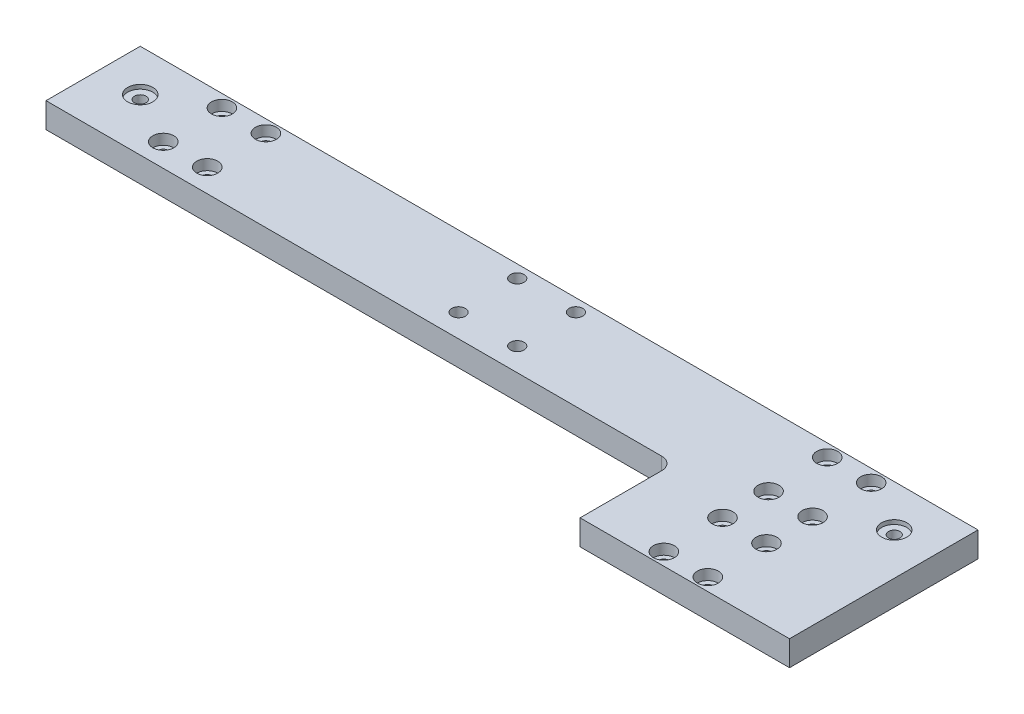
ISO-10303-21;
HEADER;
FILE_DESCRIPTION(('STEP AP214'),'2;1');
FILE_NAME('part.step','',(''),(''),'','','');
FILE_SCHEMA(('AUTOMOTIVE_DESIGN { 1 0 10303 214 1 1 1 1 }'));
ENDSEC;
DATA;
#1=APPLICATION_CONTEXT('core data for automotive mechanical design processes');
#2=APPLICATION_PROTOCOL_DEFINITION('international standard','automotive_design',2000,#1);
#3=PRODUCT_CONTEXT('',#1,'mechanical');
#4=PRODUCT('Part','Part','',(#3));
#5=PRODUCT_RELATED_PRODUCT_CATEGORY('part','',(#4));
#6=PRODUCT_DEFINITION_FORMATION('','',#4);
#7=PRODUCT_DEFINITION_CONTEXT('part definition',#1,'design');
#8=PRODUCT_DEFINITION('design','',#6,#7);
#9=PRODUCT_DEFINITION_SHAPE('','',#8);
#10=(LENGTH_UNIT() NAMED_UNIT(*) SI_UNIT(.MILLI.,.METRE.));
#11=(NAMED_UNIT(*) PLANE_ANGLE_UNIT() SI_UNIT($,.RADIAN.));
#12=(NAMED_UNIT(*) SI_UNIT($,.STERADIAN.) SOLID_ANGLE_UNIT());
#13=UNCERTAINTY_MEASURE_WITH_UNIT(LENGTH_MEASURE(1.E-05),#10,'distance_accuracy_value','');
#14=(GEOMETRIC_REPRESENTATION_CONTEXT(3) GLOBAL_UNCERTAINTY_ASSIGNED_CONTEXT((#13)) GLOBAL_UNIT_ASSIGNED_CONTEXT((#10,
#11,#12)) REPRESENTATION_CONTEXT('',''));
#15=CARTESIAN_POINT('',(0.,0.,0.));
#16=DIRECTION('',(0.,0.,1.));
#17=DIRECTION('',(1.,0.,0.));
#18=AXIS2_PLACEMENT_3D('',#15,#16,#17);
#19=CARTESIAN_POINT('',(180.,10.,0.));
#20=DIRECTION('',(0.,1.,0.));
#21=DIRECTION('',(0.,0.,1.));
#22=AXIS2_PLACEMENT_3D('',#19,#20,#21);
#23=PLANE('',#22);
#24=CARTESIAN_POINT('',(180.,10.,0.));
#25=DIRECTION('',(0.,1.,0.));
#26=DIRECTION('',(0.,0.,1.));
#27=AXIS2_PLACEMENT_3D('',#24,#25,#26);
#28=CIRCLE('',#27,6.00000000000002);
#29=CARTESIAN_POINT('',(180.,10.,6.00000000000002));
#30=VERTEX_POINT('',#29);
#31=EDGE_CURVE('E326',#30,#30,#28,.T.);
#32=ORIENTED_EDGE('',*,*,#31,.T.);
#33=EDGE_LOOP('',(#32));
#34=FACE_BOUND('',#33,.T.);
#35=CARTESIAN_POINT('',(180.,10.,0.));
#36=DIRECTION('',(0.,1.,0.));
#37=DIRECTION('',(0.,0.,1.));
#38=AXIS2_PLACEMENT_3D('',#35,#36,#37);
#39=CIRCLE('',#38,2.75000000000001);
#40=CARTESIAN_POINT('',(180.,10.,2.75000000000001));
#41=VERTEX_POINT('',#40);
#42=EDGE_CURVE('E20',#41,#41,#39,.F.);
#43=ORIENTED_EDGE('',*,*,#42,.T.);
#44=EDGE_LOOP('',(#43));
#45=FACE_BOUND('',#44,.T.);
#46=ADVANCED_FACE('F17',(#34,#45),#23,.T.);
#47=CARTESIAN_POINT('',(-180.,10.,0.));
#48=DIRECTION('',(0.,1.,0.));
#49=DIRECTION('',(0.,0.,1.));
#50=AXIS2_PLACEMENT_3D('',#47,#48,#49);
#51=PLANE('',#50);
#52=CARTESIAN_POINT('',(-180.,10.,0.));
#53=DIRECTION('',(0.,1.,0.));
#54=DIRECTION('',(0.,0.,1.));
#55=AXIS2_PLACEMENT_3D('',#52,#53,#54);
#56=CIRCLE('',#55,6.00000000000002);
#57=CARTESIAN_POINT('',(-180.,10.,6.00000000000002));
#58=VERTEX_POINT('',#57);
#59=EDGE_CURVE('E323',#58,#58,#56,.T.);
#60=ORIENTED_EDGE('',*,*,#59,.T.);
#61=EDGE_LOOP('',(#60));
#62=FACE_BOUND('',#61,.T.);
#63=CARTESIAN_POINT('',(-180.,10.,0.));
#64=DIRECTION('',(0.,1.,0.));
#65=DIRECTION('',(0.,0.,1.));
#66=AXIS2_PLACEMENT_3D('',#63,#64,#65);
#67=CIRCLE('',#66,2.75000000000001);
#68=CARTESIAN_POINT('',(-180.,10.,2.75000000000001));
#69=VERTEX_POINT('',#68);
#70=EDGE_CURVE('E328',#69,#69,#67,.F.);
#71=ORIENTED_EDGE('',*,*,#70,.T.);
#72=EDGE_LOOP('',(#71));
#73=FACE_BOUND('',#72,.T.);
#74=ADVANCED_FACE('F339',(#62,#73),#51,.T.);
#75=CARTESIAN_POINT('',(180.,0.,0.));
#76=DIRECTION('',(0.,1.,0.));
#77=DIRECTION('',(0.,0.,1.));
#78=AXIS2_PLACEMENT_3D('',#75,#76,#77);
#79=CYLINDRICAL_SURFACE('',#78,2.75000000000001);
#80=ORIENTED_EDGE('',*,*,#42,.F.);
#81=EDGE_LOOP('',(#80));
#82=FACE_BOUND('',#81,.T.);
#83=CARTESIAN_POINT('',(180.,5.,0.));
#84=DIRECTION('',(0.,1.,0.));
#85=DIRECTION('',(0.,0.,1.));
#86=AXIS2_PLACEMENT_3D('',#83,#84,#85);
#87=CIRCLE('',#86,2.75000000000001);
#88=CARTESIAN_POINT('',(180.,5.,2.75000000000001));
#89=VERTEX_POINT('',#88);
#90=EDGE_CURVE('E96',#89,#89,#87,.T.);
#91=ORIENTED_EDGE('',*,*,#90,.F.);
#92=EDGE_LOOP('',(#91));
#93=FACE_BOUND('',#92,.T.);
#94=ADVANCED_FACE('F336',(#82,#93),#79,.F.);
#95=CARTESIAN_POINT('',(-180.,0.,0.));
#96=DIRECTION('',(0.,1.,0.));
#97=DIRECTION('',(0.,0.,1.));
#98=AXIS2_PLACEMENT_3D('',#95,#96,#97);
#99=CYLINDRICAL_SURFACE('',#98,2.75000000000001);
#100=ORIENTED_EDGE('',*,*,#70,.F.);
#101=EDGE_LOOP('',(#100));
#102=FACE_BOUND('',#101,.T.);
#103=CARTESIAN_POINT('',(-180.,5.,0.));
#104=DIRECTION('',(0.,1.,0.));
#105=DIRECTION('',(0.,0.,1.));
#106=AXIS2_PLACEMENT_3D('',#103,#104,#105);
#107=CIRCLE('',#106,2.75000000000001);
#108=CARTESIAN_POINT('',(-180.,5.,2.75000000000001));
#109=VERTEX_POINT('',#108);
#110=EDGE_CURVE('E90',#109,#109,#107,.T.);
#111=ORIENTED_EDGE('',*,*,#110,.F.);
#112=EDGE_LOOP('',(#111));
#113=FACE_BOUND('',#112,.T.);
#114=ADVANCED_FACE('F83',(#102,#113),#99,.F.);
#115=CARTESIAN_POINT('',(115.00000000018,6.,50.));
#116=DIRECTION('',(-1.,0.,0.));
#117=DIRECTION('',(0.,0.,1.));
#118=AXIS2_PLACEMENT_3D('',#115,#116,#117);
#119=CONICAL_SURFACE('',#118,2.49999999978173,1.02974425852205);
#120=CARTESIAN_POINT('',(116.50215154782,6.,49.9999999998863));
#121=VERTEX_POINT('',#120);
#122=VERTEX_LOOP('',#121);
#123=FACE_BOUND('',#122,.T.);
#124=CARTESIAN_POINT('',(115.,6.,50.));
#125=DIRECTION('',(-1.,0.,0.));
#126=DIRECTION('',(0.,0.,1.));
#127=AXIS2_PLACEMENT_3D('',#124,#125,#126);
#128=CIRCLE('',#127,2.5);
#129=CARTESIAN_POINT('',(115.,6.,52.5));
#130=VERTEX_POINT('',#129);
#131=EDGE_CURVE('E87',#130,#130,#128,.T.);
#132=ORIENTED_EDGE('',*,*,#131,.T.);
#133=EDGE_LOOP('',(#132));
#134=FACE_BOUND('',#133,.T.);
#135=ADVANCED_FACE('F79',(#123,#134),#119,.F.);
#136=CARTESIAN_POINT('',(134.,7.,36.));
#137=DIRECTION('',(0.,1.,0.));
#138=DIRECTION('',(0.,0.,1.));
#139=AXIS2_PLACEMENT_3D('',#136,#137,#138);
#140=CYLINDRICAL_SURFACE('',#139,5.00000000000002);
#141=CARTESIAN_POINT('',(134.,12.,36.));
#142=DIRECTION('',(0.,1.,0.));
#143=DIRECTION('',(0.,0.,1.));
#144=AXIS2_PLACEMENT_3D('',#141,#142,#143);
#145=CIRCLE('',#144,5.00000000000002);
#146=CARTESIAN_POINT('',(134.,12.,41.));
#147=VERTEX_POINT('',#146);
#148=EDGE_CURVE('E89',#147,#147,#145,.F.);
#149=ORIENTED_EDGE('',*,*,#148,.F.);
#150=EDGE_LOOP('',(#149));
#151=FACE_BOUND('',#150,.T.);
#152=CARTESIAN_POINT('',(134.,7.,36.));
#153=DIRECTION('',(0.,1.,0.));
#154=DIRECTION('',(0.,0.,1.));
#155=AXIS2_PLACEMENT_3D('',#152,#153,#154);
#156=CIRCLE('',#155,5.00000000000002);
#157=CARTESIAN_POINT('',(134.,7.,41.));
#158=VERTEX_POINT('',#157);
#159=EDGE_CURVE('E308',#158,#158,#156,.T.);
#160=ORIENTED_EDGE('',*,*,#159,.F.);
#161=EDGE_LOOP('',(#160));
#162=FACE_BOUND('',#161,.T.);
#163=ADVANCED_FACE('F82',(#151,#162),#140,.F.);
#164=CARTESIAN_POINT('',(134.,7.,64.));
#165=DIRECTION('',(0.,1.,0.));
#166=DIRECTION('',(0.,0.,1.));
#167=AXIS2_PLACEMENT_3D('',#164,#165,#166);
#168=CYLINDRICAL_SURFACE('',#167,5.00000000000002);
#169=CARTESIAN_POINT('',(134.,12.,64.));
#170=DIRECTION('',(0.,1.,0.));
#171=DIRECTION('',(0.,0.,1.));
#172=AXIS2_PLACEMENT_3D('',#169,#170,#171);
#173=CIRCLE('',#172,5.00000000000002);
#174=CARTESIAN_POINT('',(134.,12.,69.));
#175=VERTEX_POINT('',#174);
#176=EDGE_CURVE('E93',#175,#175,#173,.F.);
#177=ORIENTED_EDGE('',*,*,#176,.F.);
#178=EDGE_LOOP('',(#177));
#179=FACE_BOUND('',#178,.T.);
#180=CARTESIAN_POINT('',(134.,7.,64.));
#181=DIRECTION('',(0.,1.,0.));
#182=DIRECTION('',(0.,0.,1.));
#183=AXIS2_PLACEMENT_3D('',#180,#181,#182);
#184=CIRCLE('',#183,5.00000000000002);
#185=CARTESIAN_POINT('',(134.,7.,69.));
#186=VERTEX_POINT('',#185);
#187=EDGE_CURVE('E305',#186,#186,#184,.T.);
#188=ORIENTED_EDGE('',*,*,#187,.F.);
#189=EDGE_LOOP('',(#188));
#190=FACE_BOUND('',#189,.T.);
#191=ADVANCED_FACE('F548',(#179,#190),#168,.F.);
#192=CARTESIAN_POINT('',(155.,7.,36.));
#193=DIRECTION('',(0.,1.,0.));
#194=DIRECTION('',(0.,0.,1.));
#195=AXIS2_PLACEMENT_3D('',#192,#193,#194);
#196=CYLINDRICAL_SURFACE('',#195,5.00000000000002);
#197=CARTESIAN_POINT('',(155.,12.,36.));
#198=DIRECTION('',(0.,1.,0.));
#199=DIRECTION('',(0.,0.,1.));
#200=AXIS2_PLACEMENT_3D('',#197,#198,#199);
#201=CIRCLE('',#200,5.00000000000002);
#202=CARTESIAN_POINT('',(155.,12.,41.));
#203=VERTEX_POINT('',#202);
#204=EDGE_CURVE('E268',#203,#203,#201,.F.);
#205=ORIENTED_EDGE('',*,*,#204,.F.);
#206=EDGE_LOOP('',(#205));
#207=FACE_BOUND('',#206,.T.);
#208=CARTESIAN_POINT('',(155.,7.,36.));
#209=DIRECTION('',(0.,1.,0.));
#210=DIRECTION('',(0.,0.,1.));
#211=AXIS2_PLACEMENT_3D('',#208,#209,#210);
#212=CIRCLE('',#211,5.00000000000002);
#213=CARTESIAN_POINT('',(155.,7.,41.));
#214=VERTEX_POINT('',#213);
#215=EDGE_CURVE('E302',#214,#214,#212,.T.);
#216=ORIENTED_EDGE('',*,*,#215,.F.);
#217=EDGE_LOOP('',(#216));
#218=FACE_BOUND('',#217,.T.);
#219=ADVANCED_FACE('F544',(#207,#218),#196,.F.);
#220=CARTESIAN_POINT('',(155.,7.,64.));
#221=DIRECTION('',(0.,1.,0.));
#222=DIRECTION('',(0.,0.,1.));
#223=AXIS2_PLACEMENT_3D('',#220,#221,#222);
#224=CYLINDRICAL_SURFACE('',#223,5.00000000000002);
#225=CARTESIAN_POINT('',(155.,12.,64.));
#226=DIRECTION('',(0.,1.,0.));
#227=DIRECTION('',(0.,0.,1.));
#228=AXIS2_PLACEMENT_3D('',#225,#226,#227);
#229=CIRCLE('',#228,5.00000000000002);
#230=CARTESIAN_POINT('',(155.,12.,69.));
#231=VERTEX_POINT('',#230);
#232=EDGE_CURVE('E265',#231,#231,#229,.F.);
#233=ORIENTED_EDGE('',*,*,#232,.F.);
#234=EDGE_LOOP('',(#233));
#235=FACE_BOUND('',#234,.T.);
#236=CARTESIAN_POINT('',(155.,7.,64.));
#237=DIRECTION('',(0.,1.,0.));
#238=DIRECTION('',(0.,0.,1.));
#239=AXIS2_PLACEMENT_3D('',#236,#237,#238);
#240=CIRCLE('',#239,5.00000000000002);
#241=CARTESIAN_POINT('',(155.,7.,69.));
#242=VERTEX_POINT('',#241);
#243=EDGE_CURVE('E299',#242,#242,#240,.T.);
#244=ORIENTED_EDGE('',*,*,#243,.F.);
#245=EDGE_LOOP('',(#244));
#246=FACE_BOUND('',#245,.T.);
#247=ADVANCED_FACE('F540',(#235,#246),#224,.F.);
#248=CARTESIAN_POINT('',(-134.,7.,14.));
#249=DIRECTION('',(0.,1.,0.));
#250=DIRECTION('',(0.,0.,1.));
#251=AXIS2_PLACEMENT_3D('',#248,#249,#250);
#252=CYLINDRICAL_SURFACE('',#251,4.99999999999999);
#253=CARTESIAN_POINT('',(-134.,12.,14.));
#254=DIRECTION('',(0.,1.,0.));
#255=DIRECTION('',(0.,0.,1.));
#256=AXIS2_PLACEMENT_3D('',#253,#254,#255);
#257=CIRCLE('',#256,4.99999999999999);
#258=CARTESIAN_POINT('',(-134.,12.,19.));
#259=VERTEX_POINT('',#258);
#260=EDGE_CURVE('E262',#259,#259,#257,.F.);
#261=ORIENTED_EDGE('',*,*,#260,.F.);
#262=EDGE_LOOP('',(#261));
#263=FACE_BOUND('',#262,.T.);
#264=CARTESIAN_POINT('',(-134.,7.,14.));
#265=DIRECTION('',(0.,1.,0.));
#266=DIRECTION('',(0.,0.,1.));
#267=AXIS2_PLACEMENT_3D('',#264,#265,#266);
#268=CIRCLE('',#267,4.99999999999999);
#269=CARTESIAN_POINT('',(-134.,7.,19.));
#270=VERTEX_POINT('',#269);
#271=EDGE_CURVE('E293',#270,#270,#268,.T.);
#272=ORIENTED_EDGE('',*,*,#271,.F.);
#273=EDGE_LOOP('',(#272));
#274=FACE_BOUND('',#273,.T.);
#275=ADVANCED_FACE('F536',(#263,#274),#252,.F.);
#276=CARTESIAN_POINT('',(155.,7.,14.));
#277=DIRECTION('',(0.,1.,0.));
#278=DIRECTION('',(0.,0.,1.));
#279=AXIS2_PLACEMENT_3D('',#276,#277,#278);
#280=CYLINDRICAL_SURFACE('',#279,4.99999999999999);
#281=CARTESIAN_POINT('',(155.,12.,14.));
#282=DIRECTION('',(0.,1.,0.));
#283=DIRECTION('',(0.,0.,1.));
#284=AXIS2_PLACEMENT_3D('',#281,#282,#283);
#285=CIRCLE('',#284,4.99999999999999);
#286=CARTESIAN_POINT('',(155.,12.,19.));
#287=VERTEX_POINT('',#286);
#288=EDGE_CURVE('E259',#287,#287,#285,.F.);
#289=ORIENTED_EDGE('',*,*,#288,.F.);
#290=EDGE_LOOP('',(#289));
#291=FACE_BOUND('',#290,.T.);
#292=CARTESIAN_POINT('',(155.,7.,14.));
#293=DIRECTION('',(0.,1.,0.));
#294=DIRECTION('',(0.,0.,1.));
#295=AXIS2_PLACEMENT_3D('',#292,#293,#294);
#296=CIRCLE('',#295,4.99999999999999);
#297=CARTESIAN_POINT('',(155.,7.,19.));
#298=VERTEX_POINT('',#297);
#299=EDGE_CURVE('E296',#298,#298,#296,.T.);
#300=ORIENTED_EDGE('',*,*,#299,.F.);
#301=EDGE_LOOP('',(#300));
#302=FACE_BOUND('',#301,.T.);
#303=ADVANCED_FACE('F532',(#291,#302),#280,.F.);
#304=CARTESIAN_POINT('',(-134.,7.,-14.));
#305=DIRECTION('',(0.,1.,0.));
#306=DIRECTION('',(0.,0.,1.));
#307=AXIS2_PLACEMENT_3D('',#304,#305,#306);
#308=CYLINDRICAL_SURFACE('',#307,4.99999999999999);
#309=CARTESIAN_POINT('',(-134.,12.,-14.));
#310=DIRECTION('',(0.,1.,0.));
#311=DIRECTION('',(0.,0.,1.));
#312=AXIS2_PLACEMENT_3D('',#309,#310,#311);
#313=CIRCLE('',#312,4.99999999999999);
#314=CARTESIAN_POINT('',(-134.,12.,-9.00000000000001));
#315=VERTEX_POINT('',#314);
#316=EDGE_CURVE('E256',#315,#315,#313,.F.);
#317=ORIENTED_EDGE('',*,*,#316,.F.);
#318=EDGE_LOOP('',(#317));
#319=FACE_BOUND('',#318,.T.);
#320=CARTESIAN_POINT('',(-134.,7.,-14.));
#321=DIRECTION('',(0.,1.,0.));
#322=DIRECTION('',(0.,0.,1.));
#323=AXIS2_PLACEMENT_3D('',#320,#321,#322);
#324=CIRCLE('',#323,4.99999999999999);
#325=CARTESIAN_POINT('',(-134.,7.,-9.00000000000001));
#326=VERTEX_POINT('',#325);
#327=EDGE_CURVE('E287',#326,#326,#324,.T.);
#328=ORIENTED_EDGE('',*,*,#327,.F.);
#329=EDGE_LOOP('',(#328));
#330=FACE_BOUND('',#329,.T.);
#331=ADVANCED_FACE('F528',(#319,#330),#308,.F.);
#332=CARTESIAN_POINT('',(155.,7.,-14.));
#333=DIRECTION('',(0.,1.,0.));
#334=DIRECTION('',(0.,0.,1.));
#335=AXIS2_PLACEMENT_3D('',#332,#333,#334);
#336=CYLINDRICAL_SURFACE('',#335,4.99999999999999);
#337=CARTESIAN_POINT('',(155.,12.,-14.));
#338=DIRECTION('',(0.,1.,0.));
#339=DIRECTION('',(0.,0.,1.));
#340=AXIS2_PLACEMENT_3D('',#337,#338,#339);
#341=CIRCLE('',#340,4.99999999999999);
#342=CARTESIAN_POINT('',(155.,12.,-9.00000000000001));
#343=VERTEX_POINT('',#342);
#344=EDGE_CURVE('E253',#343,#343,#341,.F.);
#345=ORIENTED_EDGE('',*,*,#344,.F.);
#346=EDGE_LOOP('',(#345));
#347=FACE_BOUND('',#346,.T.);
#348=CARTESIAN_POINT('',(155.,7.,-14.));
#349=DIRECTION('',(0.,1.,0.));
#350=DIRECTION('',(0.,0.,1.));
#351=AXIS2_PLACEMENT_3D('',#348,#349,#350);
#352=CIRCLE('',#351,4.99999999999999);
#353=CARTESIAN_POINT('',(155.,7.,-9.00000000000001));
#354=VERTEX_POINT('',#353);
#355=EDGE_CURVE('E290',#354,#354,#352,.T.);
#356=ORIENTED_EDGE('',*,*,#355,.F.);
#357=EDGE_LOOP('',(#356));
#358=FACE_BOUND('',#357,.T.);
#359=ADVANCED_FACE('F524',(#347,#358),#336,.F.);
#360=CARTESIAN_POINT('',(-155.,7.,14.));
#361=DIRECTION('',(0.,1.,0.));
#362=DIRECTION('',(0.,0.,1.));
#363=AXIS2_PLACEMENT_3D('',#360,#361,#362);
#364=CYLINDRICAL_SURFACE('',#363,4.99999999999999);
#365=CARTESIAN_POINT('',(-155.,12.,14.));
#366=DIRECTION('',(0.,1.,0.));
#367=DIRECTION('',(0.,0.,1.));
#368=AXIS2_PLACEMENT_3D('',#365,#366,#367);
#369=CIRCLE('',#368,4.99999999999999);
#370=CARTESIAN_POINT('',(-155.,12.,19.));
#371=VERTEX_POINT('',#370);
#372=EDGE_CURVE('E250',#371,#371,#369,.F.);
#373=ORIENTED_EDGE('',*,*,#372,.F.);
#374=EDGE_LOOP('',(#373));
#375=FACE_BOUND('',#374,.T.);
#376=CARTESIAN_POINT('',(-155.,7.,14.));
#377=DIRECTION('',(0.,1.,0.));
#378=DIRECTION('',(0.,0.,1.));
#379=AXIS2_PLACEMENT_3D('',#376,#377,#378);
#380=CIRCLE('',#379,4.99999999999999);
#381=CARTESIAN_POINT('',(-155.,7.,19.));
#382=VERTEX_POINT('',#381);
#383=EDGE_CURVE('E281',#382,#382,#380,.T.);
#384=ORIENTED_EDGE('',*,*,#383,.F.);
#385=EDGE_LOOP('',(#384));
#386=FACE_BOUND('',#385,.T.);
#387=ADVANCED_FACE('F520',(#375,#386),#364,.F.);
#388=CARTESIAN_POINT('',(134.,7.,14.));
#389=DIRECTION('',(0.,1.,0.));
#390=DIRECTION('',(0.,0.,1.));
#391=AXIS2_PLACEMENT_3D('',#388,#389,#390);
#392=CYLINDRICAL_SURFACE('',#391,4.99999999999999);
#393=CARTESIAN_POINT('',(134.,12.,14.));
#394=DIRECTION('',(0.,1.,0.));
#395=DIRECTION('',(0.,0.,1.));
#396=AXIS2_PLACEMENT_3D('',#393,#394,#395);
#397=CIRCLE('',#396,4.99999999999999);
#398=CARTESIAN_POINT('',(134.,12.,19.));
#399=VERTEX_POINT('',#398);
#400=EDGE_CURVE('E247',#399,#399,#397,.F.);
#401=ORIENTED_EDGE('',*,*,#400,.F.);
#402=EDGE_LOOP('',(#401));
#403=FACE_BOUND('',#402,.T.);
#404=CARTESIAN_POINT('',(134.,7.,14.));
#405=DIRECTION('',(0.,1.,0.));
#406=DIRECTION('',(0.,0.,1.));
#407=AXIS2_PLACEMENT_3D('',#404,#405,#406);
#408=CIRCLE('',#407,4.99999999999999);
#409=CARTESIAN_POINT('',(134.,7.,19.));
#410=VERTEX_POINT('',#409);
#411=EDGE_CURVE('E284',#410,#410,#408,.T.);
#412=ORIENTED_EDGE('',*,*,#411,.F.);
#413=EDGE_LOOP('',(#412));
#414=FACE_BOUND('',#413,.T.);
#415=ADVANCED_FACE('F516',(#403,#414),#392,.F.);
#416=CARTESIAN_POINT('',(-155.,7.,-14.));
#417=DIRECTION('',(0.,1.,0.));
#418=DIRECTION('',(0.,0.,1.));
#419=AXIS2_PLACEMENT_3D('',#416,#417,#418);
#420=CYLINDRICAL_SURFACE('',#419,4.99999999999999);
#421=CARTESIAN_POINT('',(-155.,12.,-14.));
#422=DIRECTION('',(0.,1.,0.));
#423=DIRECTION('',(0.,0.,1.));
#424=AXIS2_PLACEMENT_3D('',#421,#422,#423);
#425=CIRCLE('',#424,4.99999999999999);
#426=CARTESIAN_POINT('',(-155.,12.,-9.00000000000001));
#427=VERTEX_POINT('',#426);
#428=EDGE_CURVE('E244',#427,#427,#425,.F.);
#429=ORIENTED_EDGE('',*,*,#428,.F.);
#430=EDGE_LOOP('',(#429));
#431=FACE_BOUND('',#430,.T.);
#432=CARTESIAN_POINT('',(-155.,7.,-14.));
#433=DIRECTION('',(0.,1.,0.));
#434=DIRECTION('',(0.,0.,1.));
#435=AXIS2_PLACEMENT_3D('',#432,#433,#434);
#436=CIRCLE('',#435,4.99999999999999);
#437=CARTESIAN_POINT('',(-155.,7.,-9.00000000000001));
#438=VERTEX_POINT('',#437);
#439=EDGE_CURVE('E275',#438,#438,#436,.T.);
#440=ORIENTED_EDGE('',*,*,#439,.F.);
#441=EDGE_LOOP('',(#440));
#442=FACE_BOUND('',#441,.T.);
#443=ADVANCED_FACE('F512',(#431,#442),#420,.F.);
#444=CARTESIAN_POINT('',(134.,7.,-14.));
#445=DIRECTION('',(0.,1.,0.));
#446=DIRECTION('',(0.,0.,1.));
#447=AXIS2_PLACEMENT_3D('',#444,#445,#446);
#448=CYLINDRICAL_SURFACE('',#447,4.99999999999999);
#449=CARTESIAN_POINT('',(134.,12.,-14.));
#450=DIRECTION('',(0.,1.,0.));
#451=DIRECTION('',(0.,0.,1.));
#452=AXIS2_PLACEMENT_3D('',#449,#450,#451);
#453=CIRCLE('',#452,4.99999999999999);
#454=CARTESIAN_POINT('',(134.,12.,-9.00000000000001));
#455=VERTEX_POINT('',#454);
#456=EDGE_CURVE('E241',#455,#455,#453,.F.);
#457=ORIENTED_EDGE('',*,*,#456,.F.);
#458=EDGE_LOOP('',(#457));
#459=FACE_BOUND('',#458,.T.);
#460=CARTESIAN_POINT('',(134.,7.,-14.));
#461=DIRECTION('',(0.,1.,0.));
#462=DIRECTION('',(0.,0.,1.));
#463=AXIS2_PLACEMENT_3D('',#460,#461,#462);
#464=CIRCLE('',#463,4.99999999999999);
#465=CARTESIAN_POINT('',(134.,7.,-9.00000000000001));
#466=VERTEX_POINT('',#465);
#467=EDGE_CURVE('E278',#466,#466,#464,.T.);
#468=ORIENTED_EDGE('',*,*,#467,.F.);
#469=EDGE_LOOP('',(#468));
#470=FACE_BOUND('',#469,.T.);
#471=ADVANCED_FACE('F508',(#459,#470),#448,.F.);
#472=CARTESIAN_POINT('',(14.,12.,14.));
#473=DIRECTION('',(0.,-1.,0.));
#474=DIRECTION('',(0.,0.,-1.));
#475=AXIS2_PLACEMENT_3D('',#472,#473,#474);
#476=CYLINDRICAL_SURFACE('',#475,3.25);
#477=CARTESIAN_POINT('',(14.,6.,14.));
#478=DIRECTION('',(0.,-1.,0.));
#479=DIRECTION('',(0.,0.,-1.));
#480=AXIS2_PLACEMENT_3D('',#477,#478,#479);
#481=CIRCLE('',#480,3.25);
#482=CARTESIAN_POINT('',(14.,6.,10.75));
#483=VERTEX_POINT('',#482);
#484=EDGE_CURVE('E314',#483,#483,#481,.F.);
#485=ORIENTED_EDGE('',*,*,#484,.F.);
#486=EDGE_LOOP('',(#485));
#487=FACE_BOUND('',#486,.T.);
#488=CARTESIAN_POINT('',(14.,12.,14.));
#489=DIRECTION('',(0.,-1.,0.));
#490=DIRECTION('',(0.,0.,-1.));
#491=AXIS2_PLACEMENT_3D('',#488,#489,#490);
#492=CIRCLE('',#491,3.25);
#493=CARTESIAN_POINT('',(14.,12.,10.75));
#494=VERTEX_POINT('',#493);
#495=EDGE_CURVE('E238',#494,#494,#492,.T.);
#496=ORIENTED_EDGE('',*,*,#495,.F.);
#497=EDGE_LOOP('',(#496));
#498=FACE_BOUND('',#497,.T.);
#499=ADVANCED_FACE('F504',(#487,#498),#476,.F.);
#500=CARTESIAN_POINT('',(-14.,12.,14.));
#501=DIRECTION('',(0.,-1.,0.));
#502=DIRECTION('',(0.,0.,-1.));
#503=AXIS2_PLACEMENT_3D('',#500,#501,#502);
#504=CYLINDRICAL_SURFACE('',#503,3.25);
#505=CARTESIAN_POINT('',(-14.,6.,14.));
#506=DIRECTION('',(0.,-1.,0.));
#507=DIRECTION('',(0.,0.,-1.));
#508=AXIS2_PLACEMENT_3D('',#505,#506,#507);
#509=CIRCLE('',#508,3.25);
#510=CARTESIAN_POINT('',(-14.,6.,10.75));
#511=VERTEX_POINT('',#510);
#512=EDGE_CURVE('E311',#511,#511,#509,.F.);
#513=ORIENTED_EDGE('',*,*,#512,.F.);
#514=EDGE_LOOP('',(#513));
#515=FACE_BOUND('',#514,.T.);
#516=CARTESIAN_POINT('',(-14.,12.,14.));
#517=DIRECTION('',(0.,-1.,0.));
#518=DIRECTION('',(0.,0.,-1.));
#519=AXIS2_PLACEMENT_3D('',#516,#517,#518);
#520=CIRCLE('',#519,3.25);
#521=CARTESIAN_POINT('',(-14.,12.,10.75));
#522=VERTEX_POINT('',#521);
#523=EDGE_CURVE('E235',#522,#522,#520,.T.);
#524=ORIENTED_EDGE('',*,*,#523,.F.);
#525=EDGE_LOOP('',(#524));
#526=FACE_BOUND('',#525,.T.);
#527=ADVANCED_FACE('F500',(#515,#526),#504,.F.);
#528=CARTESIAN_POINT('',(180.,10.,0.));
#529=DIRECTION('',(0.,1.,0.));
#530=DIRECTION('',(0.,0.,1.));
#531=AXIS2_PLACEMENT_3D('',#528,#529,#530);
#532=CYLINDRICAL_SURFACE('',#531,6.00000000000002);
#533=CARTESIAN_POINT('',(180.,12.,0.));
#534=DIRECTION('',(0.,1.,0.));
#535=DIRECTION('',(0.,0.,1.));
#536=AXIS2_PLACEMENT_3D('',#533,#534,#535);
#537=CIRCLE('',#536,6.00000000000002);
#538=CARTESIAN_POINT('',(180.,12.,6.00000000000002));
#539=VERTEX_POINT('',#538);
#540=EDGE_CURVE('E232',#539,#539,#537,.F.);
#541=ORIENTED_EDGE('',*,*,#540,.F.);
#542=EDGE_LOOP('',(#541));
#543=FACE_BOUND('',#542,.T.);
#544=ORIENTED_EDGE('',*,*,#31,.F.);
#545=EDGE_LOOP('',(#544));
#546=FACE_BOUND('',#545,.T.);
#547=ADVANCED_FACE('F496',(#543,#546),#532,.F.);
#548=CARTESIAN_POINT('',(-180.,10.,0.));
#549=DIRECTION('',(0.,1.,0.));
#550=DIRECTION('',(0.,0.,1.));
#551=AXIS2_PLACEMENT_3D('',#548,#549,#550);
#552=CYLINDRICAL_SURFACE('',#551,6.00000000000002);
#553=CARTESIAN_POINT('',(-180.,12.,0.));
#554=DIRECTION('',(0.,1.,0.));
#555=DIRECTION('',(0.,0.,1.));
#556=AXIS2_PLACEMENT_3D('',#553,#554,#555);
#557=CIRCLE('',#556,6.00000000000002);
#558=CARTESIAN_POINT('',(-180.,12.,6.00000000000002));
#559=VERTEX_POINT('',#558);
#560=EDGE_CURVE('E229',#559,#559,#557,.F.);
#561=ORIENTED_EDGE('',*,*,#560,.F.);
#562=EDGE_LOOP('',(#561));
#563=FACE_BOUND('',#562,.T.);
#564=ORIENTED_EDGE('',*,*,#59,.F.);
#565=EDGE_LOOP('',(#564));
#566=FACE_BOUND('',#565,.T.);
#567=ADVANCED_FACE('F492',(#563,#566),#552,.F.);
#568=CARTESIAN_POINT('',(-14.,12.,-14.));
#569=DIRECTION('',(0.,-1.,0.));
#570=DIRECTION('',(0.,0.,-1.));
#571=AXIS2_PLACEMENT_3D('',#568,#569,#570);
#572=CYLINDRICAL_SURFACE('',#571,3.25);
#573=CARTESIAN_POINT('',(-14.,6.,-14.));
#574=DIRECTION('',(0.,-1.,0.));
#575=DIRECTION('',(0.,0.,-1.));
#576=AXIS2_PLACEMENT_3D('',#573,#574,#575);
#577=CIRCLE('',#576,3.25);
#578=CARTESIAN_POINT('',(-14.,6.,-17.25));
#579=VERTEX_POINT('',#578);
#580=EDGE_CURVE('E317',#579,#579,#577,.F.);
#581=ORIENTED_EDGE('',*,*,#580,.F.);
#582=EDGE_LOOP('',(#581));
#583=FACE_BOUND('',#582,.T.);
#584=CARTESIAN_POINT('',(-14.,12.,-14.));
#585=DIRECTION('',(0.,-1.,0.));
#586=DIRECTION('',(0.,0.,-1.));
#587=AXIS2_PLACEMENT_3D('',#584,#585,#586);
#588=CIRCLE('',#587,3.25);
#589=CARTESIAN_POINT('',(-14.,12.,-17.25));
#590=VERTEX_POINT('',#589);
#591=EDGE_CURVE('E226',#590,#590,#588,.T.);
#592=ORIENTED_EDGE('',*,*,#591,.F.);
#593=EDGE_LOOP('',(#592));
#594=FACE_BOUND('',#593,.T.);
#595=ADVANCED_FACE('F488',(#583,#594),#572,.F.);
#596=CARTESIAN_POINT('',(14.,12.,-14.));
#597=DIRECTION('',(0.,-1.,0.));
#598=DIRECTION('',(0.,0.,-1.));
#599=AXIS2_PLACEMENT_3D('',#596,#597,#598);
#600=CYLINDRICAL_SURFACE('',#599,3.25);
#601=CARTESIAN_POINT('',(14.,6.,-14.));
#602=DIRECTION('',(0.,-1.,0.));
#603=DIRECTION('',(0.,0.,-1.));
#604=AXIS2_PLACEMENT_3D('',#601,#602,#603);
#605=CIRCLE('',#604,3.25);
#606=CARTESIAN_POINT('',(14.,6.,-17.25));
#607=VERTEX_POINT('',#606);
#608=EDGE_CURVE('E320',#607,#607,#605,.F.);
#609=ORIENTED_EDGE('',*,*,#608,.F.);
#610=EDGE_LOOP('',(#609));
#611=FACE_BOUND('',#610,.T.);
#612=CARTESIAN_POINT('',(14.,12.,-14.));
#613=DIRECTION('',(0.,-1.,0.));
#614=DIRECTION('',(0.,0.,-1.));
#615=AXIS2_PLACEMENT_3D('',#612,#613,#614);
#616=CIRCLE('',#615,3.25);
#617=CARTESIAN_POINT('',(14.,12.,-17.25));
#618=VERTEX_POINT('',#617);
#619=EDGE_CURVE('E223',#618,#618,#616,.T.);
#620=ORIENTED_EDGE('',*,*,#619,.F.);
#621=EDGE_LOOP('',(#620));
#622=FACE_BOUND('',#621,.T.);
#623=ADVANCED_FACE('F484',(#611,#622),#600,.F.);
#624=CARTESIAN_POINT('',(14.,6.,-14.));
#625=DIRECTION('',(0.,-1.,0.));
#626=DIRECTION('',(0.,0.,-1.));
#627=AXIS2_PLACEMENT_3D('',#624,#625,#626);
#628=PLANE('',#627);
#629=ORIENTED_EDGE('',*,*,#608,.T.);
#630=EDGE_LOOP('',(#629));
#631=FACE_BOUND('',#630,.T.);
#632=CARTESIAN_POINT('',(14.,6.,-14.));
#633=DIRECTION('',(0.,-1.,0.));
#634=DIRECTION('',(0.,0.,-1.));
#635=AXIS2_PLACEMENT_3D('',#632,#633,#634);
#636=CIRCLE('',#635,5.5);
#637=CARTESIAN_POINT('',(14.,6.,-19.5));
#638=VERTEX_POINT('',#637);
#639=EDGE_CURVE('E220',#638,#638,#636,.T.);
#640=ORIENTED_EDGE('',*,*,#639,.T.);
#641=EDGE_LOOP('',(#640));
#642=FACE_BOUND('',#641,.T.);
#643=ADVANCED_FACE('F480',(#631,#642),#628,.T.);
#644=CARTESIAN_POINT('',(-14.,6.,-14.));
#645=DIRECTION('',(0.,-1.,0.));
#646=DIRECTION('',(0.,0.,-1.));
#647=AXIS2_PLACEMENT_3D('',#644,#645,#646);
#648=PLANE('',#647);
#649=ORIENTED_EDGE('',*,*,#580,.T.);
#650=EDGE_LOOP('',(#649));
#651=FACE_BOUND('',#650,.T.);
#652=CARTESIAN_POINT('',(-14.,6.,-14.));
#653=DIRECTION('',(0.,-1.,0.));
#654=DIRECTION('',(0.,0.,-1.));
#655=AXIS2_PLACEMENT_3D('',#652,#653,#654);
#656=CIRCLE('',#655,5.5);
#657=CARTESIAN_POINT('',(-14.,6.,-19.5));
#658=VERTEX_POINT('',#657);
#659=EDGE_CURVE('E217',#658,#658,#656,.T.);
#660=ORIENTED_EDGE('',*,*,#659,.T.);
#661=EDGE_LOOP('',(#660));
#662=FACE_BOUND('',#661,.T.);
#663=ADVANCED_FACE('F476',(#651,#662),#648,.T.);
#664=CARTESIAN_POINT('',(14.,6.,14.));
#665=DIRECTION('',(0.,-1.,0.));
#666=DIRECTION('',(0.,0.,-1.));
#667=AXIS2_PLACEMENT_3D('',#664,#665,#666);
#668=PLANE('',#667);
#669=ORIENTED_EDGE('',*,*,#484,.T.);
#670=EDGE_LOOP('',(#669));
#671=FACE_BOUND('',#670,.T.);
#672=CARTESIAN_POINT('',(14.,6.,14.));
#673=DIRECTION('',(0.,-1.,0.));
#674=DIRECTION('',(0.,0.,-1.));
#675=AXIS2_PLACEMENT_3D('',#672,#673,#674);
#676=CIRCLE('',#675,5.5);
#677=CARTESIAN_POINT('',(14.,6.,8.5));
#678=VERTEX_POINT('',#677);
#679=EDGE_CURVE('E214',#678,#678,#676,.T.);
#680=ORIENTED_EDGE('',*,*,#679,.T.);
#681=EDGE_LOOP('',(#680));
#682=FACE_BOUND('',#681,.T.);
#683=ADVANCED_FACE('F472',(#671,#682),#668,.T.);
#684=CARTESIAN_POINT('',(-14.,6.,14.));
#685=DIRECTION('',(0.,-1.,0.));
#686=DIRECTION('',(0.,0.,-1.));
#687=AXIS2_PLACEMENT_3D('',#684,#685,#686);
#688=PLANE('',#687);
#689=ORIENTED_EDGE('',*,*,#512,.T.);
#690=EDGE_LOOP('',(#689));
#691=FACE_BOUND('',#690,.T.);
#692=CARTESIAN_POINT('',(-14.,6.,14.));
#693=DIRECTION('',(0.,-1.,0.));
#694=DIRECTION('',(0.,0.,-1.));
#695=AXIS2_PLACEMENT_3D('',#692,#693,#694);
#696=CIRCLE('',#695,5.5);
#697=CARTESIAN_POINT('',(-14.,6.,8.5));
#698=VERTEX_POINT('',#697);
#699=EDGE_CURVE('E211',#698,#698,#696,.T.);
#700=ORIENTED_EDGE('',*,*,#699,.T.);
#701=EDGE_LOOP('',(#700));
#702=FACE_BOUND('',#701,.T.);
#703=ADVANCED_FACE('F468',(#691,#702),#688,.T.);
#704=CARTESIAN_POINT('',(134.,7.,36.));
#705=DIRECTION('',(0.,1.,0.));
#706=DIRECTION('',(0.,0.,1.));
#707=AXIS2_PLACEMENT_3D('',#704,#705,#706);
#708=PLANE('',#707);
#709=CARTESIAN_POINT('',(134.,7.,36.));
#710=DIRECTION('',(0.,1.,0.));
#711=DIRECTION('',(0.,0.,1.));
#712=AXIS2_PLACEMENT_3D('',#709,#710,#711);
#713=CIRCLE('',#712,2.75000000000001);
#714=CARTESIAN_POINT('',(134.,7.,38.75));
#715=VERTEX_POINT('',#714);
#716=EDGE_CURVE('E208',#715,#715,#713,.F.);
#717=ORIENTED_EDGE('',*,*,#716,.T.);
#718=EDGE_LOOP('',(#717));
#719=FACE_BOUND('',#718,.T.);
#720=ORIENTED_EDGE('',*,*,#159,.T.);
#721=EDGE_LOOP('',(#720));
#722=FACE_BOUND('',#721,.T.);
#723=ADVANCED_FACE('F464',(#719,#722),#708,.T.);
#724=CARTESIAN_POINT('',(134.,7.,64.));
#725=DIRECTION('',(0.,1.,0.));
#726=DIRECTION('',(0.,0.,1.));
#727=AXIS2_PLACEMENT_3D('',#724,#725,#726);
#728=PLANE('',#727);
#729=CARTESIAN_POINT('',(134.,7.,64.));
#730=DIRECTION('',(0.,1.,0.));
#731=DIRECTION('',(0.,0.,1.));
#732=AXIS2_PLACEMENT_3D('',#729,#730,#731);
#733=CIRCLE('',#732,2.75);
#734=CARTESIAN_POINT('',(134.,7.,66.75));
#735=VERTEX_POINT('',#734);
#736=EDGE_CURVE('E205',#735,#735,#733,.F.);
#737=ORIENTED_EDGE('',*,*,#736,.T.);
#738=EDGE_LOOP('',(#737));
#739=FACE_BOUND('',#738,.T.);
#740=ORIENTED_EDGE('',*,*,#187,.T.);
#741=EDGE_LOOP('',(#740));
#742=FACE_BOUND('',#741,.T.);
#743=ADVANCED_FACE('F460',(#739,#742),#728,.T.);
#744=CARTESIAN_POINT('',(155.,7.,36.));
#745=DIRECTION('',(0.,1.,0.));
#746=DIRECTION('',(0.,0.,1.));
#747=AXIS2_PLACEMENT_3D('',#744,#745,#746);
#748=PLANE('',#747);
#749=CARTESIAN_POINT('',(155.,7.,36.));
#750=DIRECTION('',(0.,1.,0.));
#751=DIRECTION('',(0.,0.,1.));
#752=AXIS2_PLACEMENT_3D('',#749,#750,#751);
#753=CIRCLE('',#752,2.75000000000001);
#754=CARTESIAN_POINT('',(155.,7.,38.75));
#755=VERTEX_POINT('',#754);
#756=EDGE_CURVE('E202',#755,#755,#753,.F.);
#757=ORIENTED_EDGE('',*,*,#756,.T.);
#758=EDGE_LOOP('',(#757));
#759=FACE_BOUND('',#758,.T.);
#760=ORIENTED_EDGE('',*,*,#215,.T.);
#761=EDGE_LOOP('',(#760));
#762=FACE_BOUND('',#761,.T.);
#763=ADVANCED_FACE('F456',(#759,#762),#748,.T.);
#764=CARTESIAN_POINT('',(155.,7.,64.));
#765=DIRECTION('',(0.,1.,0.));
#766=DIRECTION('',(0.,0.,1.));
#767=AXIS2_PLACEMENT_3D('',#764,#765,#766);
#768=PLANE('',#767);
#769=CARTESIAN_POINT('',(155.,7.,64.));
#770=DIRECTION('',(0.,1.,0.));
#771=DIRECTION('',(0.,0.,1.));
#772=AXIS2_PLACEMENT_3D('',#769,#770,#771);
#773=CIRCLE('',#772,2.75);
#774=CARTESIAN_POINT('',(155.,7.,66.75));
#775=VERTEX_POINT('',#774);
#776=EDGE_CURVE('E199',#775,#775,#773,.F.);
#777=ORIENTED_EDGE('',*,*,#776,.T.);
#778=EDGE_LOOP('',(#777));
#779=FACE_BOUND('',#778,.T.);
#780=ORIENTED_EDGE('',*,*,#243,.T.);
#781=EDGE_LOOP('',(#780));
#782=FACE_BOUND('',#781,.T.);
#783=ADVANCED_FACE('F452',(#779,#782),#768,.T.);
#784=CARTESIAN_POINT('',(155.,7.,14.));
#785=DIRECTION('',(0.,1.,0.));
#786=DIRECTION('',(0.,0.,1.));
#787=AXIS2_PLACEMENT_3D('',#784,#785,#786);
#788=PLANE('',#787);
#789=CARTESIAN_POINT('',(155.,7.,14.));
#790=DIRECTION('',(0.,1.,0.));
#791=DIRECTION('',(0.,0.,1.));
#792=AXIS2_PLACEMENT_3D('',#789,#790,#791);
#793=CIRCLE('',#792,2.75000000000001);
#794=CARTESIAN_POINT('',(155.,7.,16.75));
#795=VERTEX_POINT('',#794);
#796=EDGE_CURVE('E196',#795,#795,#793,.F.);
#797=ORIENTED_EDGE('',*,*,#796,.T.);
#798=EDGE_LOOP('',(#797));
#799=FACE_BOUND('',#798,.T.);
#800=ORIENTED_EDGE('',*,*,#299,.T.);
#801=EDGE_LOOP('',(#800));
#802=FACE_BOUND('',#801,.T.);
#803=ADVANCED_FACE('F448',(#799,#802),#788,.T.);
#804=CARTESIAN_POINT('',(-134.,7.,14.));
#805=DIRECTION('',(0.,1.,0.));
#806=DIRECTION('',(0.,0.,1.));
#807=AXIS2_PLACEMENT_3D('',#804,#805,#806);
#808=PLANE('',#807);
#809=CARTESIAN_POINT('',(-134.,7.,14.));
#810=DIRECTION('',(0.,1.,0.));
#811=DIRECTION('',(0.,0.,1.));
#812=AXIS2_PLACEMENT_3D('',#809,#810,#811);
#813=CIRCLE('',#812,2.75000000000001);
#814=CARTESIAN_POINT('',(-134.,7.,16.75));
#815=VERTEX_POINT('',#814);
#816=EDGE_CURVE('E193',#815,#815,#813,.F.);
#817=ORIENTED_EDGE('',*,*,#816,.T.);
#818=EDGE_LOOP('',(#817));
#819=FACE_BOUND('',#818,.T.);
#820=ORIENTED_EDGE('',*,*,#271,.T.);
#821=EDGE_LOOP('',(#820));
#822=FACE_BOUND('',#821,.T.);
#823=ADVANCED_FACE('F444',(#819,#822),#808,.T.);
#824=CARTESIAN_POINT('',(155.,7.,-14.));
#825=DIRECTION('',(0.,1.,0.));
#826=DIRECTION('',(0.,0.,1.));
#827=AXIS2_PLACEMENT_3D('',#824,#825,#826);
#828=PLANE('',#827);
#829=CARTESIAN_POINT('',(155.,7.,-14.));
#830=DIRECTION('',(0.,1.,0.));
#831=DIRECTION('',(0.,0.,1.));
#832=AXIS2_PLACEMENT_3D('',#829,#830,#831);
#833=CIRCLE('',#832,2.75000000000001);
#834=CARTESIAN_POINT('',(155.,7.,-11.25));
#835=VERTEX_POINT('',#834);
#836=EDGE_CURVE('E190',#835,#835,#833,.F.);
#837=ORIENTED_EDGE('',*,*,#836,.T.);
#838=EDGE_LOOP('',(#837));
#839=FACE_BOUND('',#838,.T.);
#840=ORIENTED_EDGE('',*,*,#355,.T.);
#841=EDGE_LOOP('',(#840));
#842=FACE_BOUND('',#841,.T.);
#843=ADVANCED_FACE('F440',(#839,#842),#828,.T.);
#844=CARTESIAN_POINT('',(-134.,7.,-14.));
#845=DIRECTION('',(0.,1.,0.));
#846=DIRECTION('',(0.,0.,1.));
#847=AXIS2_PLACEMENT_3D('',#844,#845,#846);
#848=PLANE('',#847);
#849=CARTESIAN_POINT('',(-134.,7.,-14.));
#850=DIRECTION('',(0.,1.,0.));
#851=DIRECTION('',(0.,0.,1.));
#852=AXIS2_PLACEMENT_3D('',#849,#850,#851);
#853=CIRCLE('',#852,2.75000000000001);
#854=CARTESIAN_POINT('',(-134.,7.,-11.25));
#855=VERTEX_POINT('',#854);
#856=EDGE_CURVE('E187',#855,#855,#853,.F.);
#857=ORIENTED_EDGE('',*,*,#856,.T.);
#858=EDGE_LOOP('',(#857));
#859=FACE_BOUND('',#858,.T.);
#860=ORIENTED_EDGE('',*,*,#327,.T.);
#861=EDGE_LOOP('',(#860));
#862=FACE_BOUND('',#861,.T.);
#863=ADVANCED_FACE('F436',(#859,#862),#848,.T.);
#864=CARTESIAN_POINT('',(134.,7.,14.));
#865=DIRECTION('',(0.,1.,0.));
#866=DIRECTION('',(0.,0.,1.));
#867=AXIS2_PLACEMENT_3D('',#864,#865,#866);
#868=PLANE('',#867);
#869=CARTESIAN_POINT('',(134.,7.,14.));
#870=DIRECTION('',(0.,1.,0.));
#871=DIRECTION('',(0.,0.,1.));
#872=AXIS2_PLACEMENT_3D('',#869,#870,#871);
#873=CIRCLE('',#872,2.75000000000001);
#874=CARTESIAN_POINT('',(134.,7.,16.75));
#875=VERTEX_POINT('',#874);
#876=EDGE_CURVE('E184',#875,#875,#873,.F.);
#877=ORIENTED_EDGE('',*,*,#876,.T.);
#878=EDGE_LOOP('',(#877));
#879=FACE_BOUND('',#878,.T.);
#880=ORIENTED_EDGE('',*,*,#411,.T.);
#881=EDGE_LOOP('',(#880));
#882=FACE_BOUND('',#881,.T.);
#883=ADVANCED_FACE('F432',(#879,#882),#868,.T.);
#884=CARTESIAN_POINT('',(-155.,7.,14.));
#885=DIRECTION('',(0.,1.,0.));
#886=DIRECTION('',(0.,0.,1.));
#887=AXIS2_PLACEMENT_3D('',#884,#885,#886);
#888=PLANE('',#887);
#889=CARTESIAN_POINT('',(-155.,7.,14.));
#890=DIRECTION('',(0.,1.,0.));
#891=DIRECTION('',(0.,0.,1.));
#892=AXIS2_PLACEMENT_3D('',#889,#890,#891);
#893=CIRCLE('',#892,2.75000000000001);
#894=CARTESIAN_POINT('',(-155.,7.,16.75));
#895=VERTEX_POINT('',#894);
#896=EDGE_CURVE('E181',#895,#895,#893,.F.);
#897=ORIENTED_EDGE('',*,*,#896,.T.);
#898=EDGE_LOOP('',(#897));
#899=FACE_BOUND('',#898,.T.);
#900=ORIENTED_EDGE('',*,*,#383,.T.);
#901=EDGE_LOOP('',(#900));
#902=FACE_BOUND('',#901,.T.);
#903=ADVANCED_FACE('F428',(#899,#902),#888,.T.);
#904=CARTESIAN_POINT('',(134.,7.,-14.));
#905=DIRECTION('',(0.,1.,0.));
#906=DIRECTION('',(0.,0.,1.));
#907=AXIS2_PLACEMENT_3D('',#904,#905,#906);
#908=PLANE('',#907);
#909=CARTESIAN_POINT('',(134.,7.,-14.));
#910=DIRECTION('',(0.,1.,0.));
#911=DIRECTION('',(0.,0.,1.));
#912=AXIS2_PLACEMENT_3D('',#909,#910,#911);
#913=CIRCLE('',#912,2.75000000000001);
#914=CARTESIAN_POINT('',(134.,7.,-11.25));
#915=VERTEX_POINT('',#914);
#916=EDGE_CURVE('E178',#915,#915,#913,.F.);
#917=ORIENTED_EDGE('',*,*,#916,.T.);
#918=EDGE_LOOP('',(#917));
#919=FACE_BOUND('',#918,.T.);
#920=ORIENTED_EDGE('',*,*,#467,.T.);
#921=EDGE_LOOP('',(#920));
#922=FACE_BOUND('',#921,.T.);
#923=ADVANCED_FACE('F424',(#919,#922),#908,.T.);
#924=CARTESIAN_POINT('',(-155.,7.,-14.));
#925=DIRECTION('',(0.,1.,0.));
#926=DIRECTION('',(0.,0.,1.));
#927=AXIS2_PLACEMENT_3D('',#924,#925,#926);
#928=PLANE('',#927);
#929=CARTESIAN_POINT('',(-155.,7.,-14.));
#930=DIRECTION('',(0.,1.,0.));
#931=DIRECTION('',(0.,0.,1.));
#932=AXIS2_PLACEMENT_3D('',#929,#930,#931);
#933=CIRCLE('',#932,2.75000000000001);
#934=CARTESIAN_POINT('',(-155.,7.,-11.25));
#935=VERTEX_POINT('',#934);
#936=EDGE_CURVE('E175',#935,#935,#933,.F.);
#937=ORIENTED_EDGE('',*,*,#936,.T.);
#938=EDGE_LOOP('',(#937));
#939=FACE_BOUND('',#938,.T.);
#940=ORIENTED_EDGE('',*,*,#439,.T.);
#941=EDGE_LOOP('',(#940));
#942=FACE_BOUND('',#941,.T.);
#943=ADVANCED_FACE('F347',(#939,#942),#928,.T.);
#944=CARTESIAN_POINT('',(180.,5.,0.));
#945=DIRECTION('',(0.,-1.,0.));
#946=DIRECTION('',(0.,0.,-1.));
#947=AXIS2_PLACEMENT_3D('',#944,#945,#946);
#948=PLANE('',#947);
#949=ORIENTED_EDGE('',*,*,#90,.T.);
#950=EDGE_LOOP('',(#949));
#951=FACE_BOUND('',#950,.T.);
#952=CARTESIAN_POINT('',(180.,5.,0.));
#953=DIRECTION('',(0.,-1.,0.));
#954=DIRECTION('',(0.,0.,-1.));
#955=AXIS2_PLACEMENT_3D('',#952,#953,#954);
#956=CIRCLE('',#955,4.99999999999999);
#957=CARTESIAN_POINT('',(180.,5.,-4.99999999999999));
#958=VERTEX_POINT('',#957);
#959=EDGE_CURVE('E172',#958,#958,#956,.T.);
#960=ORIENTED_EDGE('',*,*,#959,.T.);
#961=EDGE_LOOP('',(#960));
#962=FACE_BOUND('',#961,.T.);
#963=ADVANCED_FACE('F343',(#951,#962),#948,.T.);
#964=CARTESIAN_POINT('',(-180.,5.,0.));
#965=DIRECTION('',(0.,-1.,0.));
#966=DIRECTION('',(0.,0.,-1.));
#967=AXIS2_PLACEMENT_3D('',#964,#965,#966);
#968=PLANE('',#967);
#969=ORIENTED_EDGE('',*,*,#110,.T.);
#970=EDGE_LOOP('',(#969));
#971=FACE_BOUND('',#970,.T.);
#972=CARTESIAN_POINT('',(-180.,5.,0.));
#973=DIRECTION('',(0.,-1.,0.));
#974=DIRECTION('',(0.,0.,-1.));
#975=AXIS2_PLACEMENT_3D('',#972,#973,#974);
#976=CIRCLE('',#975,4.99999999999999);
#977=CARTESIAN_POINT('',(-180.,5.,-4.99999999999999));
#978=VERTEX_POINT('',#977);
#979=EDGE_CURVE('E168',#978,#978,#976,.T.);
#980=ORIENTED_EDGE('',*,*,#979,.T.);
#981=EDGE_LOOP('',(#980));
#982=FACE_BOUND('',#981,.T.);
#983=ADVANCED_FACE('F346',(#971,#982),#968,.T.);
#984=CARTESIAN_POINT('',(99.9999999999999,6.,50.));
#985=DIRECTION('',(-1.,0.,0.));
#986=DIRECTION('',(0.,0.,1.));
#987=AXIS2_PLACEMENT_3D('',#984,#985,#986);
#988=CYLINDRICAL_SURFACE('',#987,2.5);
#989=ORIENTED_EDGE('',*,*,#131,.F.);
#990=EDGE_LOOP('',(#989));
#991=FACE_BOUND('',#990,.T.);
#992=CARTESIAN_POINT('',(99.9999999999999,6.,50.));
#993=DIRECTION('',(-1.,0.,0.));
#994=DIRECTION('',(0.,0.,1.));
#995=AXIS2_PLACEMENT_3D('',#992,#993,#994);
#996=CIRCLE('',#995,2.5);
#997=CARTESIAN_POINT('',(99.9999999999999,6.,52.5));
#998=VERTEX_POINT('',#997);
#999=EDGE_CURVE('E161',#998,#998,#996,.T.);
#1000=ORIENTED_EDGE('',*,*,#999,.T.);
#1001=EDGE_LOOP('',(#1000));
#1002=FACE_BOUND('',#1001,.T.);
#1003=ADVANCED_FACE('F411',(#991,#1002),#988,.F.);
#1004=CARTESIAN_POINT('',(0.,12.,0.));
#1005=DIRECTION('',(0.,1.,0.));
#1006=DIRECTION('',(0.,0.,1.));
#1007=AXIS2_PLACEMENT_3D('',#1004,#1005,#1006);
#1008=PLANE('',#1007);
#1009=ORIENTED_EDGE('',*,*,#619,.T.);
#1010=EDGE_LOOP('',(#1009));
#1011=FACE_BOUND('',#1010,.T.);
#1012=ORIENTED_EDGE('',*,*,#591,.T.);
#1013=EDGE_LOOP('',(#1012));
#1014=FACE_BOUND('',#1013,.T.);
#1015=ORIENTED_EDGE('',*,*,#560,.T.);
#1016=EDGE_LOOP('',(#1015));
#1017=FACE_BOUND('',#1016,.T.);
#1018=ORIENTED_EDGE('',*,*,#540,.T.);
#1019=EDGE_LOOP('',(#1018));
#1020=FACE_BOUND('',#1019,.T.);
#1021=ORIENTED_EDGE('',*,*,#523,.T.);
#1022=EDGE_LOOP('',(#1021));
#1023=FACE_BOUND('',#1022,.T.);
#1024=ORIENTED_EDGE('',*,*,#495,.T.);
#1025=EDGE_LOOP('',(#1024));
#1026=FACE_BOUND('',#1025,.T.);
#1027=ORIENTED_EDGE('',*,*,#456,.T.);
#1028=EDGE_LOOP('',(#1027));
#1029=FACE_BOUND('',#1028,.T.);
#1030=ORIENTED_EDGE('',*,*,#428,.T.);
#1031=EDGE_LOOP('',(#1030));
#1032=FACE_BOUND('',#1031,.T.);
#1033=ORIENTED_EDGE('',*,*,#400,.T.);
#1034=EDGE_LOOP('',(#1033));
#1035=FACE_BOUND('',#1034,.T.);
#1036=ORIENTED_EDGE('',*,*,#372,.T.);
#1037=EDGE_LOOP('',(#1036));
#1038=FACE_BOUND('',#1037,.T.);
#1039=ORIENTED_EDGE('',*,*,#344,.T.);
#1040=EDGE_LOOP('',(#1039));
#1041=FACE_BOUND('',#1040,.T.);
#1042=ORIENTED_EDGE('',*,*,#316,.T.);
#1043=EDGE_LOOP('',(#1042));
#1044=FACE_BOUND('',#1043,.T.);
#1045=ORIENTED_EDGE('',*,*,#288,.T.);
#1046=EDGE_LOOP('',(#1045));
#1047=FACE_BOUND('',#1046,.T.);
#1048=ORIENTED_EDGE('',*,*,#260,.T.);
#1049=EDGE_LOOP('',(#1048));
#1050=FACE_BOUND('',#1049,.T.);
#1051=ORIENTED_EDGE('',*,*,#232,.T.);
#1052=EDGE_LOOP('',(#1051));
#1053=FACE_BOUND('',#1052,.T.);
#1054=ORIENTED_EDGE('',*,*,#204,.T.);
#1055=EDGE_LOOP('',(#1054));
#1056=FACE_BOUND('',#1055,.T.);
#1057=ORIENTED_EDGE('',*,*,#176,.T.);
#1058=EDGE_LOOP('',(#1057));
#1059=FACE_BOUND('',#1058,.T.);
#1060=ORIENTED_EDGE('',*,*,#148,.T.);
#1061=EDGE_LOOP('',(#1060));
#1062=FACE_BOUND('',#1061,.T.);
#1063=DIRECTION('',(1.,0.,0.));
#1064=VECTOR('',#1063,1.);
#1065=CARTESIAN_POINT('',(-200.,12.,-20.));
#1066=LINE('',#1065,#1064);
#1067=CARTESIAN_POINT('',(200.,12.,-20.));
#1068=VERTEX_POINT('',#1067);
#1069=CARTESIAN_POINT('',(-200.,12.,-20.));
#1070=VERTEX_POINT('',#1069);
#1071=EDGE_CURVE('E1104',#1068,#1070,#1066,.F.);
#1072=ORIENTED_EDGE('',*,*,#1071,.T.);
#1073=DIRECTION('',(0.,0.,-1.));
#1074=VECTOR('',#1073,1.);
#1075=CARTESIAN_POINT('',(-200.,12.,-20.));
#1076=LINE('',#1075,#1074);
#1077=CARTESIAN_POINT('',(-200.,12.,25.));
#1078=VERTEX_POINT('',#1077);
#1079=EDGE_CURVE('E56',#1070,#1078,#1076,.F.);
#1080=ORIENTED_EDGE('',*,*,#1079,.T.);
#1081=DIRECTION('',(-1.,0.,0.));
#1082=VECTOR('',#1081,1.);
#1083=CARTESIAN_POINT('',(-200.,12.,25.));
#1084=LINE('',#1083,#1082);
#1085=CARTESIAN_POINT('',(93.9999999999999,12.,25.));
#1086=VERTEX_POINT('',#1085);
#1087=EDGE_CURVE('E48',#1078,#1086,#1084,.F.);
#1088=ORIENTED_EDGE('',*,*,#1087,.T.);
#1089=CARTESIAN_POINT('',(93.9999999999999,12.,31.));
#1090=DIRECTION('',(0.,-1.,0.));
#1091=DIRECTION('',(0.,0.,-1.));
#1092=AXIS2_PLACEMENT_3D('',#1089,#1090,#1091);
#1093=CIRCLE('',#1092,6.);
#1094=CARTESIAN_POINT('',(99.9999999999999,12.,31.));
#1095=VERTEX_POINT('',#1094);
#1096=EDGE_CURVE('E165',#1086,#1095,#1093,.T.);
#1097=ORIENTED_EDGE('',*,*,#1096,.T.);
#1098=DIRECTION('',(0.,0.,-1.));
#1099=VECTOR('',#1098,1.);
#1100=CARTESIAN_POINT('',(99.9999999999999,12.,70.));
#1101=LINE('',#1100,#1099);
#1102=CARTESIAN_POINT('',(99.9999999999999,12.,70.));
#1103=VERTEX_POINT('',#1102);
#1104=EDGE_CURVE('E160',#1095,#1103,#1101,.F.);
#1105=ORIENTED_EDGE('',*,*,#1104,.T.);
#1106=DIRECTION('',(1.,0.,0.));
#1107=VECTOR('',#1106,1.);
#1108=CARTESIAN_POINT('',(0.,12.,70.));
#1109=LINE('',#1108,#1107);
#1110=CARTESIAN_POINT('',(200.,12.,70.));
#1111=VERTEX_POINT('',#1110);
#1112=EDGE_CURVE('E171',#1111,#1103,#1109,.F.);
#1113=ORIENTED_EDGE('',*,*,#1112,.F.);
#1114=DIRECTION('',(0.,0.,1.));
#1115=VECTOR('',#1114,1.);
#1116=CARTESIAN_POINT('',(200.,12.,-20.));
#1117=LINE('',#1116,#1115);
#1118=EDGE_CURVE('E1114',#1111,#1068,#1117,.F.);
#1119=ORIENTED_EDGE('',*,*,#1118,.T.);
#1120=EDGE_LOOP('',(#1072,#1080,#1088,#1097,#1105,#1113,#1119));
#1121=FACE_BOUND('',#1120,.T.);
#1122=ADVANCED_FACE('F400',(#1011,#1014,#1017,#1020,#1023,#1026,#1029,#1032,#1035,#1038,#1041,
#1044,#1047,#1050,#1053,#1056,#1059,#1062,#1121),#1008,.T.);
#1123=CARTESIAN_POINT('',(14.,6.,-14.));
#1124=DIRECTION('',(0.,-1.,0.));
#1125=DIRECTION('',(0.,0.,-1.));
#1126=AXIS2_PLACEMENT_3D('',#1123,#1124,#1125);
#1127=CYLINDRICAL_SURFACE('',#1126,5.5);
#1128=ORIENTED_EDGE('',*,*,#639,.F.);
#1129=EDGE_LOOP('',(#1128));
#1130=FACE_BOUND('',#1129,.T.);
#1131=CARTESIAN_POINT('',(14.,0.,-14.));
#1132=DIRECTION('',(0.,-1.,0.));
#1133=DIRECTION('',(0.,0.,-1.));
#1134=AXIS2_PLACEMENT_3D('',#1131,#1132,#1133);
#1135=CIRCLE('',#1134,5.5);
#1136=CARTESIAN_POINT('',(14.,0.,-19.5));
#1137=VERTEX_POINT('',#1136);
#1138=EDGE_CURVE('E157',#1137,#1137,#1135,.T.);
#1139=ORIENTED_EDGE('',*,*,#1138,.T.);
#1140=EDGE_LOOP('',(#1139));
#1141=FACE_BOUND('',#1140,.T.);
#1142=ADVANCED_FACE('F397',(#1130,#1141),#1127,.F.);
#1143=CARTESIAN_POINT('',(-14.,6.,-14.));
#1144=DIRECTION('',(0.,-1.,0.));
#1145=DIRECTION('',(0.,0.,-1.));
#1146=AXIS2_PLACEMENT_3D('',#1143,#1144,#1145);
#1147=CYLINDRICAL_SURFACE('',#1146,5.5);
#1148=ORIENTED_EDGE('',*,*,#659,.F.);
#1149=EDGE_LOOP('',(#1148));
#1150=FACE_BOUND('',#1149,.T.);
#1151=CARTESIAN_POINT('',(-14.,0.,-14.));
#1152=DIRECTION('',(0.,-1.,0.));
#1153=DIRECTION('',(0.,0.,-1.));
#1154=AXIS2_PLACEMENT_3D('',#1151,#1152,#1153);
#1155=CIRCLE('',#1154,5.5);
#1156=CARTESIAN_POINT('',(-14.,0.,-19.5));
#1157=VERTEX_POINT('',#1156);
#1158=EDGE_CURVE('E154',#1157,#1157,#1155,.T.);
#1159=ORIENTED_EDGE('',*,*,#1158,.T.);
#1160=EDGE_LOOP('',(#1159));
#1161=FACE_BOUND('',#1160,.T.);
#1162=ADVANCED_FACE('F399',(#1150,#1161),#1147,.F.);
#1163=CARTESIAN_POINT('',(14.,6.,14.));
#1164=DIRECTION('',(0.,-1.,0.));
#1165=DIRECTION('',(0.,0.,-1.));
#1166=AXIS2_PLACEMENT_3D('',#1163,#1164,#1165);
#1167=CYLINDRICAL_SURFACE('',#1166,5.5);
#1168=ORIENTED_EDGE('',*,*,#679,.F.);
#1169=EDGE_LOOP('',(#1168));
#1170=FACE_BOUND('',#1169,.T.);
#1171=CARTESIAN_POINT('',(14.,0.,14.));
#1172=DIRECTION('',(0.,-1.,0.));
#1173=DIRECTION('',(0.,0.,-1.));
#1174=AXIS2_PLACEMENT_3D('',#1171,#1172,#1173);
#1175=CIRCLE('',#1174,5.5);
#1176=CARTESIAN_POINT('',(14.,0.,8.5));
#1177=VERTEX_POINT('',#1176);
#1178=EDGE_CURVE('E151',#1177,#1177,#1175,.T.);
#1179=ORIENTED_EDGE('',*,*,#1178,.T.);
#1180=EDGE_LOOP('',(#1179));
#1181=FACE_BOUND('',#1180,.T.);
#1182=ADVANCED_FACE('F408',(#1170,#1181),#1167,.F.);
#1183=CARTESIAN_POINT('',(-14.,6.,14.));
#1184=DIRECTION('',(0.,-1.,0.));
#1185=DIRECTION('',(0.,0.,-1.));
#1186=AXIS2_PLACEMENT_3D('',#1183,#1184,#1185);
#1187=CYLINDRICAL_SURFACE('',#1186,5.5);
#1188=ORIENTED_EDGE('',*,*,#699,.F.);
#1189=EDGE_LOOP('',(#1188));
#1190=FACE_BOUND('',#1189,.T.);
#1191=CARTESIAN_POINT('',(-14.,0.,14.));
#1192=DIRECTION('',(0.,-1.,0.));
#1193=DIRECTION('',(0.,0.,-1.));
#1194=AXIS2_PLACEMENT_3D('',#1191,#1192,#1193);
#1195=CIRCLE('',#1194,5.5);
#1196=CARTESIAN_POINT('',(-14.,0.,8.5));
#1197=VERTEX_POINT('',#1196);
#1198=EDGE_CURVE('E148',#1197,#1197,#1195,.T.);
#1199=ORIENTED_EDGE('',*,*,#1198,.T.);
#1200=EDGE_LOOP('',(#1199));
#1201=FACE_BOUND('',#1200,.T.);
#1202=ADVANCED_FACE('F845',(#1190,#1201),#1187,.F.);
#1203=CARTESIAN_POINT('',(134.,0.,36.));
#1204=DIRECTION('',(0.,1.,0.));
#1205=DIRECTION('',(0.,0.,1.));
#1206=AXIS2_PLACEMENT_3D('',#1203,#1204,#1205);
#1207=CYLINDRICAL_SURFACE('',#1206,2.75000000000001);
#1208=CARTESIAN_POINT('',(134.,0.,36.));
#1209=DIRECTION('',(0.,1.,0.));
#1210=DIRECTION('',(0.,0.,1.));
#1211=AXIS2_PLACEMENT_3D('',#1208,#1209,#1210);
#1212=CIRCLE('',#1211,2.75000000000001);
#1213=CARTESIAN_POINT('',(134.,0.,38.75));
#1214=VERTEX_POINT('',#1213);
#1215=EDGE_CURVE('E145',#1214,#1214,#1212,.F.);
#1216=ORIENTED_EDGE('',*,*,#1215,.T.);
#1217=EDGE_LOOP('',(#1216));
#1218=FACE_BOUND('',#1217,.T.);
#1219=ORIENTED_EDGE('',*,*,#716,.F.);
#1220=EDGE_LOOP('',(#1219));
#1221=FACE_BOUND('',#1220,.T.);
#1222=ADVANCED_FACE('F854',(#1218,#1221),#1207,.F.);
#1223=CARTESIAN_POINT('',(134.,0.,64.));
#1224=DIRECTION('',(0.,1.,0.));
#1225=DIRECTION('',(0.,0.,1.));
#1226=AXIS2_PLACEMENT_3D('',#1223,#1224,#1225);
#1227=CYLINDRICAL_SURFACE('',#1226,2.75);
#1228=CARTESIAN_POINT('',(134.,0.,64.));
#1229=DIRECTION('',(0.,1.,0.));
#1230=DIRECTION('',(0.,0.,1.));
#1231=AXIS2_PLACEMENT_3D('',#1228,#1229,#1230);
#1232=CIRCLE('',#1231,2.75);
#1233=CARTESIAN_POINT('',(134.,0.,66.75));
#1234=VERTEX_POINT('',#1233);
#1235=EDGE_CURVE('E142',#1234,#1234,#1232,.F.);
#1236=ORIENTED_EDGE('',*,*,#1235,.T.);
#1237=EDGE_LOOP('',(#1236));
#1238=FACE_BOUND('',#1237,.T.);
#1239=ORIENTED_EDGE('',*,*,#736,.F.);
#1240=EDGE_LOOP('',(#1239));
#1241=FACE_BOUND('',#1240,.T.);
#1242=ADVANCED_FACE('F864',(#1238,#1241),#1227,.F.);
#1243=CARTESIAN_POINT('',(155.,0.,36.));
#1244=DIRECTION('',(0.,1.,0.));
#1245=DIRECTION('',(0.,0.,1.));
#1246=AXIS2_PLACEMENT_3D('',#1243,#1244,#1245);
#1247=CYLINDRICAL_SURFACE('',#1246,2.75000000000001);
#1248=CARTESIAN_POINT('',(155.,0.,36.));
#1249=DIRECTION('',(0.,1.,0.));
#1250=DIRECTION('',(0.,0.,1.));
#1251=AXIS2_PLACEMENT_3D('',#1248,#1249,#1250);
#1252=CIRCLE('',#1251,2.75000000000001);
#1253=CARTESIAN_POINT('',(155.,0.,38.75));
#1254=VERTEX_POINT('',#1253);
#1255=EDGE_CURVE('E139',#1254,#1254,#1252,.F.);
#1256=ORIENTED_EDGE('',*,*,#1255,.T.);
#1257=EDGE_LOOP('',(#1256));
#1258=FACE_BOUND('',#1257,.T.);
#1259=ORIENTED_EDGE('',*,*,#756,.F.);
#1260=EDGE_LOOP('',(#1259));
#1261=FACE_BOUND('',#1260,.T.);
#1262=ADVANCED_FACE('F874',(#1258,#1261),#1247,.F.);
#1263=CARTESIAN_POINT('',(155.,0.,64.));
#1264=DIRECTION('',(0.,1.,0.));
#1265=DIRECTION('',(0.,0.,1.));
#1266=AXIS2_PLACEMENT_3D('',#1263,#1264,#1265);
#1267=CYLINDRICAL_SURFACE('',#1266,2.75);
#1268=CARTESIAN_POINT('',(155.,0.,64.));
#1269=DIRECTION('',(0.,1.,0.));
#1270=DIRECTION('',(0.,0.,1.));
#1271=AXIS2_PLACEMENT_3D('',#1268,#1269,#1270);
#1272=CIRCLE('',#1271,2.75);
#1273=CARTESIAN_POINT('',(155.,0.,66.75));
#1274=VERTEX_POINT('',#1273);
#1275=EDGE_CURVE('E136',#1274,#1274,#1272,.F.);
#1276=ORIENTED_EDGE('',*,*,#1275,.T.);
#1277=EDGE_LOOP('',(#1276));
#1278=FACE_BOUND('',#1277,.T.);
#1279=ORIENTED_EDGE('',*,*,#776,.F.);
#1280=EDGE_LOOP('',(#1279));
#1281=FACE_BOUND('',#1280,.T.);
#1282=ADVANCED_FACE('F884',(#1278,#1281),#1267,.F.);
#1283=CARTESIAN_POINT('',(155.,0.,14.));
#1284=DIRECTION('',(0.,1.,0.));
#1285=DIRECTION('',(0.,0.,1.));
#1286=AXIS2_PLACEMENT_3D('',#1283,#1284,#1285);
#1287=CYLINDRICAL_SURFACE('',#1286,2.75000000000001);
#1288=CARTESIAN_POINT('',(155.,0.,14.));
#1289=DIRECTION('',(0.,1.,0.));
#1290=DIRECTION('',(0.,0.,1.));
#1291=AXIS2_PLACEMENT_3D('',#1288,#1289,#1290);
#1292=CIRCLE('',#1291,2.75000000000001);
#1293=CARTESIAN_POINT('',(155.,0.,16.75));
#1294=VERTEX_POINT('',#1293);
#1295=EDGE_CURVE('E133',#1294,#1294,#1292,.F.);
#1296=ORIENTED_EDGE('',*,*,#1295,.T.);
#1297=EDGE_LOOP('',(#1296));
#1298=FACE_BOUND('',#1297,.T.);
#1299=ORIENTED_EDGE('',*,*,#796,.F.);
#1300=EDGE_LOOP('',(#1299));
#1301=FACE_BOUND('',#1300,.T.);
#1302=ADVANCED_FACE('F894',(#1298,#1301),#1287,.F.);
#1303=CARTESIAN_POINT('',(-134.,0.,14.));
#1304=DIRECTION('',(0.,1.,0.));
#1305=DIRECTION('',(0.,0.,1.));
#1306=AXIS2_PLACEMENT_3D('',#1303,#1304,#1305);
#1307=CYLINDRICAL_SURFACE('',#1306,2.75000000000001);
#1308=CARTESIAN_POINT('',(-134.,0.,14.));
#1309=DIRECTION('',(0.,1.,0.));
#1310=DIRECTION('',(0.,0.,1.));
#1311=AXIS2_PLACEMENT_3D('',#1308,#1309,#1310);
#1312=CIRCLE('',#1311,2.75000000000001);
#1313=CARTESIAN_POINT('',(-134.,0.,16.75));
#1314=VERTEX_POINT('',#1313);
#1315=EDGE_CURVE('E130',#1314,#1314,#1312,.F.);
#1316=ORIENTED_EDGE('',*,*,#1315,.T.);
#1317=EDGE_LOOP('',(#1316));
#1318=FACE_BOUND('',#1317,.T.);
#1319=ORIENTED_EDGE('',*,*,#816,.F.);
#1320=EDGE_LOOP('',(#1319));
#1321=FACE_BOUND('',#1320,.T.);
#1322=ADVANCED_FACE('F904',(#1318,#1321),#1307,.F.);
#1323=CARTESIAN_POINT('',(155.,0.,-14.));
#1324=DIRECTION('',(0.,1.,0.));
#1325=DIRECTION('',(0.,0.,1.));
#1326=AXIS2_PLACEMENT_3D('',#1323,#1324,#1325);
#1327=CYLINDRICAL_SURFACE('',#1326,2.75000000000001);
#1328=CARTESIAN_POINT('',(155.,0.,-14.));
#1329=DIRECTION('',(0.,1.,0.));
#1330=DIRECTION('',(0.,0.,1.));
#1331=AXIS2_PLACEMENT_3D('',#1328,#1329,#1330);
#1332=CIRCLE('',#1331,2.75000000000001);
#1333=CARTESIAN_POINT('',(155.,0.,-11.25));
#1334=VERTEX_POINT('',#1333);
#1335=EDGE_CURVE('E127',#1334,#1334,#1332,.F.);
#1336=ORIENTED_EDGE('',*,*,#1335,.T.);
#1337=EDGE_LOOP('',(#1336));
#1338=FACE_BOUND('',#1337,.T.);
#1339=ORIENTED_EDGE('',*,*,#836,.F.);
#1340=EDGE_LOOP('',(#1339));
#1341=FACE_BOUND('',#1340,.T.);
#1342=ADVANCED_FACE('F914',(#1338,#1341),#1327,.F.);
#1343=CARTESIAN_POINT('',(-134.,0.,-14.));
#1344=DIRECTION('',(0.,1.,0.));
#1345=DIRECTION('',(0.,0.,1.));
#1346=AXIS2_PLACEMENT_3D('',#1343,#1344,#1345);
#1347=CYLINDRICAL_SURFACE('',#1346,2.75000000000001);
#1348=CARTESIAN_POINT('',(-134.,0.,-14.));
#1349=DIRECTION('',(0.,1.,0.));
#1350=DIRECTION('',(0.,0.,1.));
#1351=AXIS2_PLACEMENT_3D('',#1348,#1349,#1350);
#1352=CIRCLE('',#1351,2.75000000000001);
#1353=CARTESIAN_POINT('',(-134.,0.,-11.25));
#1354=VERTEX_POINT('',#1353);
#1355=EDGE_CURVE('E124',#1354,#1354,#1352,.F.);
#1356=ORIENTED_EDGE('',*,*,#1355,.T.);
#1357=EDGE_LOOP('',(#1356));
#1358=FACE_BOUND('',#1357,.T.);
#1359=ORIENTED_EDGE('',*,*,#856,.F.);
#1360=EDGE_LOOP('',(#1359));
#1361=FACE_BOUND('',#1360,.T.);
#1362=ADVANCED_FACE('F924',(#1358,#1361),#1347,.F.);
#1363=CARTESIAN_POINT('',(134.,0.,14.));
#1364=DIRECTION('',(0.,1.,0.));
#1365=DIRECTION('',(0.,0.,1.));
#1366=AXIS2_PLACEMENT_3D('',#1363,#1364,#1365);
#1367=CYLINDRICAL_SURFACE('',#1366,2.75000000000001);
#1368=CARTESIAN_POINT('',(134.,0.,14.));
#1369=DIRECTION('',(0.,1.,0.));
#1370=DIRECTION('',(0.,0.,1.));
#1371=AXIS2_PLACEMENT_3D('',#1368,#1369,#1370);
#1372=CIRCLE('',#1371,2.75000000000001);
#1373=CARTESIAN_POINT('',(134.,0.,16.75));
#1374=VERTEX_POINT('',#1373);
#1375=EDGE_CURVE('E121',#1374,#1374,#1372,.F.);
#1376=ORIENTED_EDGE('',*,*,#1375,.T.);
#1377=EDGE_LOOP('',(#1376));
#1378=FACE_BOUND('',#1377,.T.);
#1379=ORIENTED_EDGE('',*,*,#876,.F.);
#1380=EDGE_LOOP('',(#1379));
#1381=FACE_BOUND('',#1380,.T.);
#1382=ADVANCED_FACE('F934',(#1378,#1381),#1367,.F.);
#1383=CARTESIAN_POINT('',(-155.,0.,14.));
#1384=DIRECTION('',(0.,1.,0.));
#1385=DIRECTION('',(0.,0.,1.));
#1386=AXIS2_PLACEMENT_3D('',#1383,#1384,#1385);
#1387=CYLINDRICAL_SURFACE('',#1386,2.75000000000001);
#1388=CARTESIAN_POINT('',(-155.,0.,14.));
#1389=DIRECTION('',(0.,1.,0.));
#1390=DIRECTION('',(0.,0.,1.));
#1391=AXIS2_PLACEMENT_3D('',#1388,#1389,#1390);
#1392=CIRCLE('',#1391,2.75000000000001);
#1393=CARTESIAN_POINT('',(-155.,0.,16.75));
#1394=VERTEX_POINT('',#1393);
#1395=EDGE_CURVE('E118',#1394,#1394,#1392,.F.);
#1396=ORIENTED_EDGE('',*,*,#1395,.T.);
#1397=EDGE_LOOP('',(#1396));
#1398=FACE_BOUND('',#1397,.T.);
#1399=ORIENTED_EDGE('',*,*,#896,.F.);
#1400=EDGE_LOOP('',(#1399));
#1401=FACE_BOUND('',#1400,.T.);
#1402=ADVANCED_FACE('F944',(#1398,#1401),#1387,.F.);
#1403=CARTESIAN_POINT('',(134.,0.,-14.));
#1404=DIRECTION('',(0.,1.,0.));
#1405=DIRECTION('',(0.,0.,1.));
#1406=AXIS2_PLACEMENT_3D('',#1403,#1404,#1405);
#1407=CYLINDRICAL_SURFACE('',#1406,2.75000000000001);
#1408=CARTESIAN_POINT('',(134.,0.,-14.));
#1409=DIRECTION('',(0.,1.,0.));
#1410=DIRECTION('',(0.,0.,1.));
#1411=AXIS2_PLACEMENT_3D('',#1408,#1409,#1410);
#1412=CIRCLE('',#1411,2.75000000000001);
#1413=CARTESIAN_POINT('',(134.,0.,-11.25));
#1414=VERTEX_POINT('',#1413);
#1415=EDGE_CURVE('E115',#1414,#1414,#1412,.F.);
#1416=ORIENTED_EDGE('',*,*,#1415,.T.);
#1417=EDGE_LOOP('',(#1416));
#1418=FACE_BOUND('',#1417,.T.);
#1419=ORIENTED_EDGE('',*,*,#916,.F.);
#1420=EDGE_LOOP('',(#1419));
#1421=FACE_BOUND('',#1420,.T.);
#1422=ADVANCED_FACE('F954',(#1418,#1421),#1407,.F.);
#1423=CARTESIAN_POINT('',(-155.,0.,-14.));
#1424=DIRECTION('',(0.,1.,0.));
#1425=DIRECTION('',(0.,0.,1.));
#1426=AXIS2_PLACEMENT_3D('',#1423,#1424,#1425);
#1427=CYLINDRICAL_SURFACE('',#1426,2.75000000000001);
#1428=CARTESIAN_POINT('',(-155.,0.,-14.));
#1429=DIRECTION('',(0.,1.,0.));
#1430=DIRECTION('',(0.,0.,1.));
#1431=AXIS2_PLACEMENT_3D('',#1428,#1429,#1430);
#1432=CIRCLE('',#1431,2.75000000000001);
#1433=CARTESIAN_POINT('',(-155.,0.,-11.25));
#1434=VERTEX_POINT('',#1433);
#1435=EDGE_CURVE('E112',#1434,#1434,#1432,.F.);
#1436=ORIENTED_EDGE('',*,*,#1435,.T.);
#1437=EDGE_LOOP('',(#1436));
#1438=FACE_BOUND('',#1437,.T.);
#1439=ORIENTED_EDGE('',*,*,#936,.F.);
#1440=EDGE_LOOP('',(#1439));
#1441=FACE_BOUND('',#1440,.T.);
#1442=ADVANCED_FACE('F355',(#1438,#1441),#1427,.F.);
#1443=CARTESIAN_POINT('',(180.,5.,0.));
#1444=DIRECTION('',(0.,-1.,0.));
#1445=DIRECTION('',(0.,0.,-1.));
#1446=AXIS2_PLACEMENT_3D('',#1443,#1444,#1445);
#1447=CYLINDRICAL_SURFACE('',#1446,4.99999999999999);
#1448=ORIENTED_EDGE('',*,*,#959,.F.);
#1449=EDGE_LOOP('',(#1448));
#1450=FACE_BOUND('',#1449,.T.);
#1451=CARTESIAN_POINT('',(180.,0.,0.));
#1452=DIRECTION('',(0.,-1.,0.));
#1453=DIRECTION('',(0.,0.,-1.));
#1454=AXIS2_PLACEMENT_3D('',#1451,#1452,#1453);
#1455=CIRCLE('',#1454,4.99999999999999);
#1456=CARTESIAN_POINT('',(180.,0.,-4.99999999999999));
#1457=VERTEX_POINT('',#1456);
#1458=EDGE_CURVE('E109',#1457,#1457,#1455,.T.);
#1459=ORIENTED_EDGE('',*,*,#1458,.T.);
#1460=EDGE_LOOP('',(#1459));
#1461=FACE_BOUND('',#1460,.T.);
#1462=ADVANCED_FACE('F351',(#1450,#1461),#1447,.F.);
#1463=CARTESIAN_POINT('',(-180.,5.,0.));
#1464=DIRECTION('',(0.,-1.,0.));
#1465=DIRECTION('',(0.,0.,-1.));
#1466=AXIS2_PLACEMENT_3D('',#1463,#1464,#1465);
#1467=CYLINDRICAL_SURFACE('',#1466,4.99999999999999);
#1468=ORIENTED_EDGE('',*,*,#979,.F.);
#1469=EDGE_LOOP('',(#1468));
#1470=FACE_BOUND('',#1469,.T.);
#1471=CARTESIAN_POINT('',(-180.,0.,0.));
#1472=DIRECTION('',(0.,-1.,0.));
#1473=DIRECTION('',(0.,0.,-1.));
#1474=AXIS2_PLACEMENT_3D('',#1471,#1472,#1473);
#1475=CIRCLE('',#1474,4.99999999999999);
#1476=CARTESIAN_POINT('',(-180.,0.,-4.99999999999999));
#1477=VERTEX_POINT('',#1476);
#1478=EDGE_CURVE('E105',#1477,#1477,#1475,.T.);
#1479=ORIENTED_EDGE('',*,*,#1478,.T.);
#1480=EDGE_LOOP('',(#1479));
#1481=FACE_BOUND('',#1480,.T.);
#1482=ADVANCED_FACE('F354',(#1470,#1481),#1467,.F.);
#1483=CARTESIAN_POINT('',(0.,0.,70.));
#1484=DIRECTION('',(0.,0.,1.));
#1485=DIRECTION('',(1.,0.,0.));
#1486=AXIS2_PLACEMENT_3D('',#1483,#1484,#1485);
#1487=PLANE('',#1486);
#1488=DIRECTION('',(0.,1.,0.));
#1489=VECTOR('',#1488,1.);
#1490=CARTESIAN_POINT('',(200.,12.,70.));
#1491=LINE('',#1490,#1489);
#1492=CARTESIAN_POINT('',(200.,0.,70.));
#1493=VERTEX_POINT('',#1492);
#1494=EDGE_CURVE('E1121',#1493,#1111,#1491,.T.);
#1495=ORIENTED_EDGE('',*,*,#1494,.T.);
#1496=ORIENTED_EDGE('',*,*,#1112,.T.);
#1497=DIRECTION('',(0.,1.,0.));
#1498=VECTOR('',#1497,1.);
#1499=CARTESIAN_POINT('',(99.9999999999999,0.,70.));
#1500=LINE('',#1499,#1498);
#1501=CARTESIAN_POINT('',(99.9999999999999,0.,70.));
#1502=VERTEX_POINT('',#1501);
#1503=EDGE_CURVE('E164',#1103,#1502,#1500,.F.);
#1504=ORIENTED_EDGE('',*,*,#1503,.T.);
#1505=DIRECTION('',(1.,0.,0.));
#1506=VECTOR('',#1505,1.);
#1507=CARTESIAN_POINT('',(0.,0.,70.));
#1508=LINE('',#1507,#1506);
#1509=EDGE_CURVE('E108',#1502,#1493,#1508,.T.);
#1510=ORIENTED_EDGE('',*,*,#1509,.T.);
#1511=EDGE_LOOP('',(#1495,#1496,#1504,#1510));
#1512=FACE_BOUND('',#1511,.T.);
#1513=ADVANCED_FACE('F988',(#1512),#1487,.T.);
#1514=CARTESIAN_POINT('',(200.,12.,-20.));
#1515=DIRECTION('',(-1.,0.,0.));
#1516=DIRECTION('',(0.,0.,1.));
#1517=AXIS2_PLACEMENT_3D('',#1514,#1515,#1516);
#1518=PLANE('',#1517);
#1519=DIRECTION('',(0.,1.,0.));
#1520=VECTOR('',#1519,1.);
#1521=CARTESIAN_POINT('',(200.,12.,-20.));
#1522=LINE('',#1521,#1520);
#1523=CARTESIAN_POINT('',(200.,0.,-20.));
#1524=VERTEX_POINT('',#1523);
#1525=EDGE_CURVE('E1111',#1524,#1068,#1522,.T.);
#1526=ORIENTED_EDGE('',*,*,#1525,.T.);
#1527=ORIENTED_EDGE('',*,*,#1118,.F.);
#1528=ORIENTED_EDGE('',*,*,#1494,.F.);
#1529=DIRECTION('',(0.,0.,1.));
#1530=VECTOR('',#1529,1.);
#1531=CARTESIAN_POINT('',(200.,0.,0.));
#1532=LINE('',#1531,#1530);
#1533=EDGE_CURVE('E1086',#1493,#1524,#1532,.F.);
#1534=ORIENTED_EDGE('',*,*,#1533,.T.);
#1535=EDGE_LOOP('',(#1526,#1527,#1528,#1534));
#1536=FACE_BOUND('',#1535,.T.);
#1537=ADVANCED_FACE('F998',(#1536),#1518,.F.);
#1538=CARTESIAN_POINT('',(-200.,12.,-20.));
#1539=DIRECTION('',(0.,0.,1.));
#1540=DIRECTION('',(1.,0.,0.));
#1541=AXIS2_PLACEMENT_3D('',#1538,#1539,#1540);
#1542=PLANE('',#1541);
#1543=DIRECTION('',(0.,1.,0.));
#1544=VECTOR('',#1543,1.);
#1545=CARTESIAN_POINT('',(-200.,12.,-20.));
#1546=LINE('',#1545,#1544);
#1547=CARTESIAN_POINT('',(-200.,0.,-20.));
#1548=VERTEX_POINT('',#1547);
#1549=EDGE_CURVE('E1101',#1548,#1070,#1546,.T.);
#1550=ORIENTED_EDGE('',*,*,#1549,.T.);
#1551=ORIENTED_EDGE('',*,*,#1071,.F.);
#1552=ORIENTED_EDGE('',*,*,#1525,.F.);
#1553=DIRECTION('',(1.,0.,0.));
#1554=VECTOR('',#1553,1.);
#1555=CARTESIAN_POINT('',(0.,0.,-20.));
#1556=LINE('',#1555,#1554);
#1557=EDGE_CURVE('E1098',#1524,#1548,#1556,.F.);
#1558=ORIENTED_EDGE('',*,*,#1557,.T.);
#1559=EDGE_LOOP('',(#1550,#1551,#1552,#1558));
#1560=FACE_BOUND('',#1559,.T.);
#1561=ADVANCED_FACE('F1008',(#1560),#1542,.F.);
#1562=CARTESIAN_POINT('',(-200.,12.,-20.));
#1563=DIRECTION('',(1.,0.,0.));
#1564=DIRECTION('',(0.,0.,-1.));
#1565=AXIS2_PLACEMENT_3D('',#1562,#1563,#1564);
#1566=PLANE('',#1565);
#1567=DIRECTION('',(0.,1.,0.));
#1568=VECTOR('',#1567,1.);
#1569=CARTESIAN_POINT('',(-200.,0.,25.));
#1570=LINE('',#1569,#1568);
#1571=CARTESIAN_POINT('',(-200.,0.,25.));
#1572=VERTEX_POINT('',#1571);
#1573=EDGE_CURVE('E1090',#1572,#1078,#1570,.T.);
#1574=ORIENTED_EDGE('',*,*,#1573,.T.);
#1575=ORIENTED_EDGE('',*,*,#1079,.F.);
#1576=ORIENTED_EDGE('',*,*,#1549,.F.);
#1577=DIRECTION('',(0.,0.,1.));
#1578=VECTOR('',#1577,1.);
#1579=CARTESIAN_POINT('',(-200.,0.,0.));
#1580=LINE('',#1579,#1578);
#1581=EDGE_CURVE('E1095',#1548,#1572,#1580,.T.);
#1582=ORIENTED_EDGE('',*,*,#1581,.T.);
#1583=EDGE_LOOP('',(#1574,#1575,#1576,#1582));
#1584=FACE_BOUND('',#1583,.T.);
#1585=ADVANCED_FACE('F1018',(#1584),#1566,.F.);
#1586=CARTESIAN_POINT('',(-200.,0.,25.));
#1587=DIRECTION('',(0.,0.,-1.));
#1588=DIRECTION('',(-1.,0.,0.));
#1589=AXIS2_PLACEMENT_3D('',#1586,#1587,#1588);
#1590=PLANE('',#1589);
#1591=DIRECTION('',(0.,-1.,0.));
#1592=VECTOR('',#1591,1.);
#1593=CARTESIAN_POINT('',(93.9999999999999,0.,25.));
#1594=LINE('',#1593,#1592);
#1595=CARTESIAN_POINT('',(93.9999999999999,0.,25.));
#1596=VERTEX_POINT('',#1595);
#1597=EDGE_CURVE('E167',#1596,#1086,#1594,.F.);
#1598=ORIENTED_EDGE('',*,*,#1597,.T.);
#1599=ORIENTED_EDGE('',*,*,#1087,.F.);
#1600=ORIENTED_EDGE('',*,*,#1573,.F.);
#1601=DIRECTION('',(1.,0.,0.));
#1602=VECTOR('',#1601,1.);
#1603=CARTESIAN_POINT('',(0.,0.,25.));
#1604=LINE('',#1603,#1602);
#1605=EDGE_CURVE('E104',#1572,#1596,#1604,.T.);
#1606=ORIENTED_EDGE('',*,*,#1605,.T.);
#1607=EDGE_LOOP('',(#1598,#1599,#1600,#1606));
#1608=FACE_BOUND('',#1607,.T.);
#1609=ADVANCED_FACE('F1028',(#1608),#1590,.F.);
#1610=CARTESIAN_POINT('',(93.9999999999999,0.,31.));
#1611=DIRECTION('',(0.,-1.,0.));
#1612=DIRECTION('',(0.,0.,-1.));
#1613=AXIS2_PLACEMENT_3D('',#1610,#1611,#1612);
#1614=CYLINDRICAL_SURFACE('',#1613,6.);
#1615=DIRECTION('',(0.,1.,0.));
#1616=VECTOR('',#1615,1.);
#1617=CARTESIAN_POINT('',(99.9999999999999,0.,31.));
#1618=LINE('',#1617,#1616);
#1619=CARTESIAN_POINT('',(99.9999999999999,0.,31.));
#1620=VERTEX_POINT('',#1619);
#1621=EDGE_CURVE('E34',#1620,#1095,#1618,.T.);
#1622=ORIENTED_EDGE('',*,*,#1621,.T.);
#1623=ORIENTED_EDGE('',*,*,#1096,.F.);
#1624=ORIENTED_EDGE('',*,*,#1597,.F.);
#1625=CARTESIAN_POINT('',(93.9999999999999,0.,31.));
#1626=DIRECTION('',(0.,-1.,0.));
#1627=DIRECTION('',(0.,0.,-1.));
#1628=AXIS2_PLACEMENT_3D('',#1625,#1626,#1627);
#1629=CIRCLE('',#1628,6.);
#1630=EDGE_CURVE('E26',#1596,#1620,#1629,.T.);
#1631=ORIENTED_EDGE('',*,*,#1630,.T.);
#1632=EDGE_LOOP('',(#1622,#1623,#1624,#1631));
#1633=FACE_BOUND('',#1632,.T.);
#1634=ADVANCED_FACE('F1038',(#1633),#1614,.F.);
#1635=CARTESIAN_POINT('',(99.9999999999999,0.,70.));
#1636=DIRECTION('',(1.,0.,0.));
#1637=DIRECTION('',(0.,0.,-1.));
#1638=AXIS2_PLACEMENT_3D('',#1635,#1636,#1637);
#1639=PLANE('',#1638);
#1640=ORIENTED_EDGE('',*,*,#1621,.F.);
#1641=DIRECTION('',(0.,0.,1.));
#1642=VECTOR('',#1641,1.);
#1643=CARTESIAN_POINT('',(99.9999999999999,0.,0.));
#1644=LINE('',#1643,#1642);
#1645=EDGE_CURVE('E11',#1620,#1502,#1644,.T.);
#1646=ORIENTED_EDGE('',*,*,#1645,.T.);
#1647=ORIENTED_EDGE('',*,*,#1503,.F.);
#1648=ORIENTED_EDGE('',*,*,#1104,.F.);
#1649=EDGE_LOOP('',(#1640,#1646,#1647,#1648));
#1650=FACE_BOUND('',#1649,.T.);
#1651=ORIENTED_EDGE('',*,*,#999,.F.);
#1652=EDGE_LOOP('',(#1651));
#1653=FACE_BOUND('',#1652,.T.);
#1654=ADVANCED_FACE('F362',(#1650,#1653),#1639,.F.);
#1655=CARTESIAN_POINT('',(0.,0.,0.));
#1656=DIRECTION('',(0.,1.,0.));
#1657=DIRECTION('',(0.,0.,1.));
#1658=AXIS2_PLACEMENT_3D('',#1655,#1656,#1657);
#1659=PLANE('',#1658);
#1660=ORIENTED_EDGE('',*,*,#1630,.F.);
#1661=ORIENTED_EDGE('',*,*,#1605,.F.);
#1662=ORIENTED_EDGE('',*,*,#1581,.F.);
#1663=ORIENTED_EDGE('',*,*,#1557,.F.);
#1664=ORIENTED_EDGE('',*,*,#1533,.F.);
#1665=ORIENTED_EDGE('',*,*,#1509,.F.);
#1666=ORIENTED_EDGE('',*,*,#1645,.F.);
#1667=EDGE_LOOP('',(#1660,#1661,#1662,#1663,#1664,#1665,#1666));
#1668=FACE_BOUND('',#1667,.T.);
#1669=ORIENTED_EDGE('',*,*,#1478,.F.);
#1670=EDGE_LOOP('',(#1669));
#1671=FACE_BOUND('',#1670,.T.);
#1672=ORIENTED_EDGE('',*,*,#1458,.F.);
#1673=EDGE_LOOP('',(#1672));
#1674=FACE_BOUND('',#1673,.T.);
#1675=ORIENTED_EDGE('',*,*,#1435,.F.);
#1676=EDGE_LOOP('',(#1675));
#1677=FACE_BOUND('',#1676,.T.);
#1678=ORIENTED_EDGE('',*,*,#1415,.F.);
#1679=EDGE_LOOP('',(#1678));
#1680=FACE_BOUND('',#1679,.T.);
#1681=ORIENTED_EDGE('',*,*,#1395,.F.);
#1682=EDGE_LOOP('',(#1681));
#1683=FACE_BOUND('',#1682,.T.);
#1684=ORIENTED_EDGE('',*,*,#1375,.F.);
#1685=EDGE_LOOP('',(#1684));
#1686=FACE_BOUND('',#1685,.T.);
#1687=ORIENTED_EDGE('',*,*,#1355,.F.);
#1688=EDGE_LOOP('',(#1687));
#1689=FACE_BOUND('',#1688,.T.);
#1690=ORIENTED_EDGE('',*,*,#1335,.F.);
#1691=EDGE_LOOP('',(#1690));
#1692=FACE_BOUND('',#1691,.T.);
#1693=ORIENTED_EDGE('',*,*,#1315,.F.);
#1694=EDGE_LOOP('',(#1693));
#1695=FACE_BOUND('',#1694,.T.);
#1696=ORIENTED_EDGE('',*,*,#1295,.F.);
#1697=EDGE_LOOP('',(#1696));
#1698=FACE_BOUND('',#1697,.T.);
#1699=ORIENTED_EDGE('',*,*,#1275,.F.);
#1700=EDGE_LOOP('',(#1699));
#1701=FACE_BOUND('',#1700,.T.);
#1702=ORIENTED_EDGE('',*,*,#1255,.F.);
#1703=EDGE_LOOP('',(#1702));
#1704=FACE_BOUND('',#1703,.T.);
#1705=ORIENTED_EDGE('',*,*,#1235,.F.);
#1706=EDGE_LOOP('',(#1705));
#1707=FACE_BOUND('',#1706,.T.);
#1708=ORIENTED_EDGE('',*,*,#1215,.F.);
#1709=EDGE_LOOP('',(#1708));
#1710=FACE_BOUND('',#1709,.T.);
#1711=ORIENTED_EDGE('',*,*,#1198,.F.);
#1712=EDGE_LOOP('',(#1711));
#1713=FACE_BOUND('',#1712,.T.);
#1714=ORIENTED_EDGE('',*,*,#1178,.F.);
#1715=EDGE_LOOP('',(#1714));
#1716=FACE_BOUND('',#1715,.T.);
#1717=ORIENTED_EDGE('',*,*,#1158,.F.);
#1718=EDGE_LOOP('',(#1717));
#1719=FACE_BOUND('',#1718,.T.);
#1720=ORIENTED_EDGE('',*,*,#1138,.F.);
#1721=EDGE_LOOP('',(#1720));
#1722=FACE_BOUND('',#1721,.T.);
#1723=ADVANCED_FACE('F359',(#1668,#1671,#1674,#1677,#1680,#1683,#1686,#1689,#1692,#1695,#1698,
#1701,#1704,#1707,#1710,#1713,#1716,#1719,#1722),#1659,.F.);
#1724=CLOSED_SHELL('',(#46,#74,#94,#114,#135,#163,#191,#219,#247,#275,#303,#331,#359,#387,#415,
#443,#471,#499,#527,#547,#567,#595,#623,#643,#663,#683,#703,#723,#743,#763,#783,#803,#823,#843,
#863,#883,#903,#923,#943,#963,#983,#1003,#1122,#1142,#1162,#1182,#1202,#1222,#1242,#1262,#1282,
#1302,#1322,#1342,#1362,#1382,#1402,#1422,#1442,#1462,#1482,#1513,#1537,#1561,#1585,#1609,#1634,
#1654,#1723));
#1725=MANIFOLD_SOLID_BREP('B1',#1724);
#1726=ADVANCED_BREP_SHAPE_REPRESENTATION('',(#18,#1725),#14);
#1727=SHAPE_DEFINITION_REPRESENTATION(#9,#1726);
ENDSEC;
END-ISO-10303-21;
